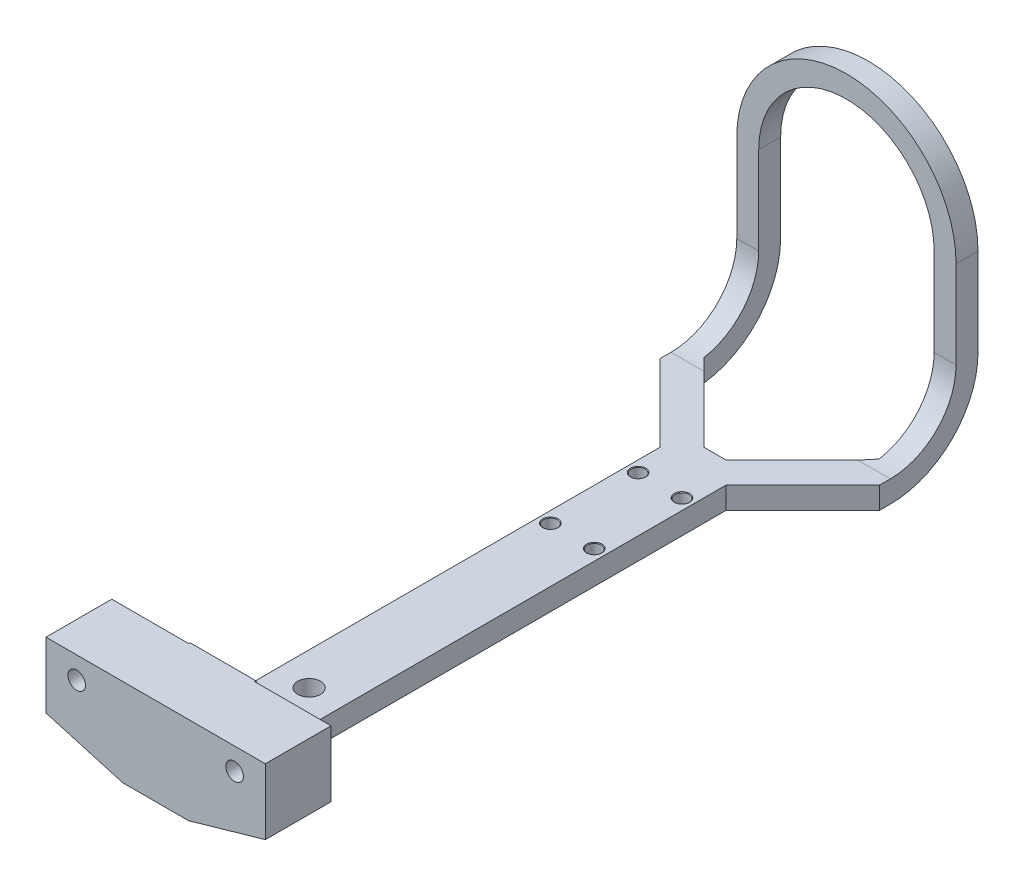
ISO-10303-21;
HEADER;
FILE_DESCRIPTION(('STEP AP214'),'2;1');
FILE_NAME('part.step','',(''),(''),'','','');
FILE_SCHEMA(('AUTOMOTIVE_DESIGN { 1 0 10303 214 1 1 1 1 }'));
ENDSEC;
DATA;
#1=APPLICATION_CONTEXT('core data for automotive mechanical design processes');
#2=APPLICATION_PROTOCOL_DEFINITION('international standard','automotive_design',2000,#1);
#3=PRODUCT_CONTEXT('',#1,'mechanical');
#4=PRODUCT('Part','Part','',(#3));
#5=PRODUCT_RELATED_PRODUCT_CATEGORY('part','',(#4));
#6=PRODUCT_DEFINITION_FORMATION('','',#4);
#7=PRODUCT_DEFINITION_CONTEXT('part definition',#1,'design');
#8=PRODUCT_DEFINITION('design','',#6,#7);
#9=PRODUCT_DEFINITION_SHAPE('','',#8);
#10=(LENGTH_UNIT() NAMED_UNIT(*) SI_UNIT(.MILLI.,.METRE.));
#11=(NAMED_UNIT(*) PLANE_ANGLE_UNIT() SI_UNIT($,.RADIAN.));
#12=(NAMED_UNIT(*) SI_UNIT($,.STERADIAN.) SOLID_ANGLE_UNIT());
#13=UNCERTAINTY_MEASURE_WITH_UNIT(LENGTH_MEASURE(1.E-05),#10,'distance_accuracy_value','');
#14=(GEOMETRIC_REPRESENTATION_CONTEXT(3) GLOBAL_UNCERTAINTY_ASSIGNED_CONTEXT((#13)) GLOBAL_UNIT_ASSIGNED_CONTEXT((#10,
#11,#12)) REPRESENTATION_CONTEXT('',''));
#15=CARTESIAN_POINT('',(0.,0.,0.));
#16=DIRECTION('',(0.,0.,1.));
#17=DIRECTION('',(1.,0.,0.));
#18=AXIS2_PLACEMENT_3D('',#15,#16,#17);
#19=CARTESIAN_POINT('',(0.,5.,0.));
#20=DIRECTION('',(0.,1.,0.));
#21=DIRECTION('',(0.,0.,1.));
#22=AXIS2_PLACEMENT_3D('',#19,#20,#21);
#23=PLANE('',#22);
#24=CARTESIAN_POINT('',(0.,5.,70.));
#25=DIRECTION('',(0.,1.,0.));
#26=DIRECTION('',(0.,0.,1.));
#27=AXIS2_PLACEMENT_3D('',#24,#25,#26);
#28=CIRCLE('',#27,2.6);
#29=CARTESIAN_POINT('',(0.,5.,72.6));
#30=VERTEX_POINT('',#29);
#31=EDGE_CURVE('E436',#30,#30,#28,.F.);
#32=ORIENTED_EDGE('',*,*,#31,.T.);
#33=EDGE_LOOP('',(#32));
#34=FACE_BOUND('',#33,.T.);
#35=CARTESIAN_POINT('',(5.,5.,10.));
#36=DIRECTION('',(0.,1.,0.));
#37=DIRECTION('',(0.,0.,1.));
#38=AXIS2_PLACEMENT_3D('',#35,#36,#37);
#39=CIRCLE('',#38,1.75);
#40=CARTESIAN_POINT('',(5.,5.,11.75));
#41=VERTEX_POINT('',#40);
#42=EDGE_CURVE('E442',#41,#41,#39,.T.);
#43=ORIENTED_EDGE('',*,*,#42,.F.);
#44=EDGE_LOOP('',(#43));
#45=FACE_BOUND('',#44,.T.);
#46=CARTESIAN_POINT('',(-5.,5.,-10.));
#47=DIRECTION('',(0.,1.,0.));
#48=DIRECTION('',(0.,0.,1.));
#49=AXIS2_PLACEMENT_3D('',#46,#47,#48);
#50=CIRCLE('',#49,1.75);
#51=CARTESIAN_POINT('',(-5.,5.,-8.25));
#52=VERTEX_POINT('',#51);
#53=EDGE_CURVE('E451',#52,#52,#50,.T.);
#54=ORIENTED_EDGE('',*,*,#53,.F.);
#55=EDGE_LOOP('',(#54));
#56=FACE_BOUND('',#55,.T.);
#57=CARTESIAN_POINT('',(-5.,5.,10.));
#58=DIRECTION('',(0.,1.,0.));
#59=DIRECTION('',(0.,0.,1.));
#60=AXIS2_PLACEMENT_3D('',#57,#58,#59);
#61=CIRCLE('',#60,1.75);
#62=CARTESIAN_POINT('',(-5.,5.,11.75));
#63=VERTEX_POINT('',#62);
#64=EDGE_CURVE('E460',#63,#63,#61,.T.);
#65=ORIENTED_EDGE('',*,*,#64,.F.);
#66=EDGE_LOOP('',(#65));
#67=FACE_BOUND('',#66,.T.);
#68=CARTESIAN_POINT('',(5.,5.,-10.));
#69=DIRECTION('',(0.,1.,0.));
#70=DIRECTION('',(0.,0.,1.));
#71=AXIS2_PLACEMENT_3D('',#68,#69,#70);
#72=CIRCLE('',#71,1.75);
#73=CARTESIAN_POINT('',(5.,5.,-8.25));
#74=VERTEX_POINT('',#73);
#75=EDGE_CURVE('E469',#74,#74,#72,.T.);
#76=ORIENTED_EDGE('',*,*,#75,.F.);
#77=EDGE_LOOP('',(#76));
#78=FACE_BOUND('',#77,.T.);
#79=DIRECTION('',(0.,0.,-1.));
#80=VECTOR('',#79,1.);
#81=CARTESIAN_POINT('',(-25.,5.,0.));
#82=LINE('',#81,#80);
#83=CARTESIAN_POINT('',(-25.,5.,-35.0000000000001));
#84=VERTEX_POINT('',#83);
#85=CARTESIAN_POINT('',(-25.,5.,-37.5));
#86=VERTEX_POINT('',#85);
#87=EDGE_CURVE('E359',#84,#86,#82,.T.);
#88=ORIENTED_EDGE('',*,*,#87,.F.);
#89=DIRECTION('',(-0.707106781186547,0.,-0.707106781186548));
#90=VECTOR('',#89,1.);
#91=CARTESIAN_POINT('',(5.00000000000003,5.,-5.00000000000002));
#92=LINE('',#91,#90);
#93=CARTESIAN_POINT('',(-7.5,5.,-17.5));
#94=VERTEX_POINT('',#93);
#95=EDGE_CURVE('E592',#84,#94,#92,.F.);
#96=ORIENTED_EDGE('',*,*,#95,.T.);
#97=DIRECTION('',(0.,0.,1.));
#98=VECTOR('',#97,1.);
#99=CARTESIAN_POINT('',(-7.5,5.,0.));
#100=LINE('',#99,#98);
#101=CARTESIAN_POINT('',(-7.49999999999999,5.,82.9999999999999));
#102=VERTEX_POINT('',#101);
#103=EDGE_CURVE('E479',#94,#102,#100,.T.);
#104=ORIENTED_EDGE('',*,*,#103,.T.);
#105=DIRECTION('',(1.,0.,0.));
#106=VECTOR('',#105,1.);
#107=CARTESIAN_POINT('',(0.,5.,82.9999999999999));
#108=LINE('',#107,#106);
#109=CARTESIAN_POINT('',(7.50000000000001,5.,82.9999999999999));
#110=VERTEX_POINT('',#109);
#111=EDGE_CURVE('E507',#102,#110,#108,.T.);
#112=ORIENTED_EDGE('',*,*,#111,.T.);
#113=DIRECTION('',(0.,0.,1.));
#114=VECTOR('',#113,1.);
#115=CARTESIAN_POINT('',(7.5,5.,0.));
#116=LINE('',#115,#114);
#117=CARTESIAN_POINT('',(7.5,5.,-17.5));
#118=VERTEX_POINT('',#117);
#119=EDGE_CURVE('E481',#118,#110,#116,.T.);
#120=ORIENTED_EDGE('',*,*,#119,.F.);
#121=DIRECTION('',(-0.707106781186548,0.,0.707106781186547));
#122=VECTOR('',#121,1.);
#123=CARTESIAN_POINT('',(-5.00000000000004,5.,-5.00000000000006));
#124=LINE('',#123,#122);
#125=CARTESIAN_POINT('',(25.,5.,-35.));
#126=VERTEX_POINT('',#125);
#127=EDGE_CURVE('E590',#118,#126,#124,.F.);
#128=ORIENTED_EDGE('',*,*,#127,.T.);
#129=DIRECTION('',(0.,0.,1.));
#130=VECTOR('',#129,1.);
#131=CARTESIAN_POINT('',(25.,5.,0.));
#132=LINE('',#131,#130);
#133=CARTESIAN_POINT('',(25.,5.,-37.5));
#134=VERTEX_POINT('',#133);
#135=EDGE_CURVE('E373',#134,#126,#132,.T.);
#136=ORIENTED_EDGE('',*,*,#135,.F.);
#137=DIRECTION('',(1.,0.,0.));
#138=VECTOR('',#137,1.);
#139=CARTESIAN_POINT('',(0.,5.,-37.5));
#140=LINE('',#139,#138);
#141=CARTESIAN_POINT('',(17.5,5.,-37.5));
#142=VERTEX_POINT('',#141);
#143=EDGE_CURVE('E139',#134,#142,#140,.F.);
#144=ORIENTED_EDGE('',*,*,#143,.T.);
#145=DIRECTION('',(-0.707106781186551,0.,0.707106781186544));
#146=VECTOR('',#145,1.);
#147=CARTESIAN_POINT('',(20.,5.,-39.9999999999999));
#148=LINE('',#147,#146);
#149=CARTESIAN_POINT('',(2.49999999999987,5.,-22.5));
#150=VERTEX_POINT('',#149);
#151=EDGE_CURVE('E584',#142,#150,#148,.T.);
#152=ORIENTED_EDGE('',*,*,#151,.T.);
#153=DIRECTION('',(-1.,0.,0.));
#154=VECTOR('',#153,1.);
#155=CARTESIAN_POINT('',(7.5,5.,-22.5));
#156=LINE('',#155,#154);
#157=CARTESIAN_POINT('',(-2.50000000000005,5.,-22.5));
#158=VERTEX_POINT('',#157);
#159=EDGE_CURVE('E364',#150,#158,#156,.T.);
#160=ORIENTED_EDGE('',*,*,#159,.T.);
#161=DIRECTION('',(0.707106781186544,0.,0.707106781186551));
#162=VECTOR('',#161,1.);
#163=CARTESIAN_POINT('',(-2.50000000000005,5.,-22.5));
#164=LINE('',#163,#162);
#165=CARTESIAN_POINT('',(-17.4999999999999,5.,-37.5));
#166=VERTEX_POINT('',#165);
#167=EDGE_CURVE('E572',#158,#166,#164,.F.);
#168=ORIENTED_EDGE('',*,*,#167,.T.);
#169=DIRECTION('',(-1.,0.,0.));
#170=VECTOR('',#169,1.);
#171=CARTESIAN_POINT('',(0.,5.,-37.5));
#172=LINE('',#171,#170);
#173=EDGE_CURVE('E529',#166,#86,#172,.T.);
#174=ORIENTED_EDGE('',*,*,#173,.T.);
#175=EDGE_LOOP('',(#88,#96,#104,#112,#120,#128,#136,#144,#152,#160,#168,#174));
#176=FACE_BOUND('',#175,.T.);
#177=ADVANCED_FACE('F115',(#34,#45,#56,#67,#78,#176),#23,.T.);
#178=CARTESIAN_POINT('',(-7.5,5.,0.));
#179=DIRECTION('',(1.,0.,0.));
#180=DIRECTION('',(0.,0.,-1.));
#181=AXIS2_PLACEMENT_3D('',#178,#179,#180);
#182=PLANE('',#181);
#183=DIRECTION('',(0.,1.,0.));
#184=VECTOR('',#183,1.);
#185=CARTESIAN_POINT('',(-7.5,0.,-17.5));
#186=LINE('',#185,#184);
#187=CARTESIAN_POINT('',(-7.5,0.,-17.5));
#188=VERTEX_POINT('',#187);
#189=EDGE_CURVE('E358',#188,#94,#186,.T.);
#190=ORIENTED_EDGE('',*,*,#189,.F.);
#191=DIRECTION('',(0.,0.,1.));
#192=VECTOR('',#191,1.);
#193=CARTESIAN_POINT('',(-7.5,0.,0.));
#194=LINE('',#193,#192);
#195=CARTESIAN_POINT('',(-7.49999999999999,0.,90.));
#196=VERTEX_POINT('',#195);
#197=EDGE_CURVE('E485',#188,#196,#194,.T.);
#198=ORIENTED_EDGE('',*,*,#197,.T.);
#199=DIRECTION('',(0.,1.,0.));
#200=VECTOR('',#199,1.);
#201=CARTESIAN_POINT('',(-7.49999999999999,20.,90.));
#202=LINE('',#201,#200);
#203=CARTESIAN_POINT('',(-7.49999999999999,20.,90.));
#204=VERTEX_POINT('',#203);
#205=EDGE_CURVE('E496',#196,#204,#202,.T.);
#206=ORIENTED_EDGE('',*,*,#205,.T.);
#207=DIRECTION('',(0.,0.,1.));
#208=VECTOR('',#207,1.);
#209=CARTESIAN_POINT('',(-7.5,20.,0.));
#210=LINE('',#209,#208);
#211=CARTESIAN_POINT('',(-7.49999999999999,20.,89.6784302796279));
#212=VERTEX_POINT('',#211);
#213=EDGE_CURVE('E518',#204,#212,#210,.F.);
#214=ORIENTED_EDGE('',*,*,#213,.T.);
#215=DIRECTION('',(0.,-0.913545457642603,-0.406736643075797));
#216=VECTOR('',#215,1.);
#217=CARTESIAN_POINT('',(-7.49999999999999,-25.8405102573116,69.2689201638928));
#218=LINE('',#217,#216);
#219=EDGE_CURVE('E512',#212,#102,#218,.T.);
#220=ORIENTED_EDGE('',*,*,#219,.T.);
#221=ORIENTED_EDGE('',*,*,#103,.F.);
#222=EDGE_LOOP('',(#190,#198,#206,#214,#220,#221));
#223=FACE_BOUND('',#222,.T.);
#224=ADVANCED_FACE('F656',(#223),#182,.F.);
#225=CARTESIAN_POINT('',(7.5,5.,0.));
#226=DIRECTION('',(1.,0.,0.));
#227=DIRECTION('',(0.,0.,-1.));
#228=AXIS2_PLACEMENT_3D('',#225,#226,#227);
#229=PLANE('',#228);
#230=DIRECTION('',(0.,0.,1.));
#231=VECTOR('',#230,1.);
#232=CARTESIAN_POINT('',(7.5,0.,0.));
#233=LINE('',#232,#231);
#234=CARTESIAN_POINT('',(7.5,0.,-17.5));
#235=VERTEX_POINT('',#234);
#236=CARTESIAN_POINT('',(7.50000000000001,0.,90.));
#237=VERTEX_POINT('',#236);
#238=EDGE_CURVE('E482',#235,#237,#233,.T.);
#239=ORIENTED_EDGE('',*,*,#238,.F.);
#240=DIRECTION('',(0.,1.,0.));
#241=VECTOR('',#240,1.);
#242=CARTESIAN_POINT('',(7.5,0.,-17.5));
#243=LINE('',#242,#241);
#244=EDGE_CURVE('E361',#235,#118,#243,.T.);
#245=ORIENTED_EDGE('',*,*,#244,.T.);
#246=ORIENTED_EDGE('',*,*,#119,.T.);
#247=DIRECTION('',(0.,0.913545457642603,0.406736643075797));
#248=VECTOR('',#247,1.);
#249=CARTESIAN_POINT('',(7.50000000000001,20.7222574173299,90.));
#250=LINE('',#249,#248);
#251=CARTESIAN_POINT('',(7.50000000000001,20.,89.6784302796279));
#252=VERTEX_POINT('',#251);
#253=EDGE_CURVE('E515',#110,#252,#250,.T.);
#254=ORIENTED_EDGE('',*,*,#253,.T.);
#255=DIRECTION('',(0.,0.,-1.));
#256=VECTOR('',#255,1.);
#257=CARTESIAN_POINT('',(7.5,20.,0.));
#258=LINE('',#257,#256);
#259=CARTESIAN_POINT('',(7.50000000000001,20.,90.));
#260=VERTEX_POINT('',#259);
#261=EDGE_CURVE('E517',#260,#252,#258,.T.);
#262=ORIENTED_EDGE('',*,*,#261,.F.);
#263=DIRECTION('',(0.,-1.,0.));
#264=VECTOR('',#263,1.);
#265=CARTESIAN_POINT('',(7.50000000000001,5.,90.));
#266=LINE('',#265,#264);
#267=EDGE_CURVE('E484',#260,#237,#266,.T.);
#268=ORIENTED_EDGE('',*,*,#267,.T.);
#269=EDGE_LOOP('',(#239,#245,#246,#254,#262,#268));
#270=FACE_BOUND('',#269,.T.);
#271=ADVANCED_FACE('F605',(#270),#229,.T.);
#272=CARTESIAN_POINT('',(-25.,20.,90.));
#273=DIRECTION('',(0.,0.,1.));
#274=DIRECTION('',(1.,0.,0.));
#275=AXIS2_PLACEMENT_3D('',#272,#273,#274);
#276=PLANE('',#275);
#277=CARTESIAN_POINT('',(-18.,15.,90.));
#278=DIRECTION('',(0.,0.,1.));
#279=DIRECTION('',(1.,0.,0.));
#280=AXIS2_PLACEMENT_3D('',#277,#278,#279);
#281=CIRCLE('',#280,2.00000000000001);
#282=CARTESIAN_POINT('',(-16.,15.,90.));
#283=VERTEX_POINT('',#282);
#284=EDGE_CURVE('E394',#283,#283,#281,.T.);
#285=ORIENTED_EDGE('',*,*,#284,.T.);
#286=EDGE_LOOP('',(#285));
#287=FACE_BOUND('',#286,.T.);
#288=DIRECTION('',(-1.,0.,0.));
#289=VECTOR('',#288,1.);
#290=CARTESIAN_POINT('',(-25.,20.,90.));
#291=LINE('',#290,#289);
#292=CARTESIAN_POINT('',(-25.,20.,90.));
#293=VERTEX_POINT('',#292);
#294=EDGE_CURVE('E406',#204,#293,#291,.T.);
#295=ORIENTED_EDGE('',*,*,#294,.F.);
#296=ORIENTED_EDGE('',*,*,#205,.F.);
#297=DIRECTION('',(0.961261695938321,-0.275637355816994,0.));
#298=VECTOR('',#297,1.);
#299=CARTESIAN_POINT('',(-28.9696134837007,6.15631260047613,90.));
#300=LINE('',#299,#298);
#301=CARTESIAN_POINT('',(-24.9370722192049,5.,90.));
#302=VERTEX_POINT('',#301);
#303=EDGE_CURVE('E505',#196,#302,#300,.F.);
#304=ORIENTED_EDGE('',*,*,#303,.T.);
#305=DIRECTION('',(-1.,0.,0.));
#306=VECTOR('',#305,1.);
#307=CARTESIAN_POINT('',(-25.,5.,90.));
#308=LINE('',#307,#306);
#309=CARTESIAN_POINT('',(-25.,5.,90.));
#310=VERTEX_POINT('',#309);
#311=EDGE_CURVE('E419',#302,#310,#308,.T.);
#312=ORIENTED_EDGE('',*,*,#311,.T.);
#313=DIRECTION('',(0.,-1.,0.));
#314=VECTOR('',#313,1.);
#315=CARTESIAN_POINT('',(-25.,20.,90.));
#316=LINE('',#315,#314);
#317=EDGE_CURVE('E410',#293,#310,#316,.T.);
#318=ORIENTED_EDGE('',*,*,#317,.F.);
#319=EDGE_LOOP('',(#295,#296,#304,#312,#318));
#320=FACE_BOUND('',#319,.T.);
#321=ADVANCED_FACE('F693',(#287,#320),#276,.F.);
#322=CARTESIAN_POINT('',(0.,0.,0.));
#323=DIRECTION('',(0.,1.,0.));
#324=DIRECTION('',(0.,0.,1.));
#325=AXIS2_PLACEMENT_3D('',#322,#323,#324);
#326=PLANE('',#325);
#327=ORIENTED_EDGE('',*,*,#197,.F.);
#328=DIRECTION('',(0.707106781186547,0.,0.707106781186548));
#329=VECTOR('',#328,1.);
#330=CARTESIAN_POINT('',(-25.,0.,-35.0000000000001));
#331=LINE('',#330,#329);
#332=CARTESIAN_POINT('',(-25.,0.,-35.0000000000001));
#333=VERTEX_POINT('',#332);
#334=EDGE_CURVE('E12',#188,#333,#331,.F.);
#335=ORIENTED_EDGE('',*,*,#334,.T.);
#336=DIRECTION('',(0.,0.,-1.));
#337=VECTOR('',#336,1.);
#338=CARTESIAN_POINT('',(-25.,0.,0.));
#339=LINE('',#338,#337);
#340=CARTESIAN_POINT('',(-25.,0.,-37.5));
#341=VERTEX_POINT('',#340);
#342=EDGE_CURVE('E356',#333,#341,#339,.T.);
#343=ORIENTED_EDGE('',*,*,#342,.T.);
#344=DIRECTION('',(1.,0.,0.));
#345=VECTOR('',#344,1.);
#346=CARTESIAN_POINT('',(0.,0.,-37.5));
#347=LINE('',#346,#345);
#348=CARTESIAN_POINT('',(-17.4999999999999,0.,-37.5));
#349=VERTEX_POINT('',#348);
#350=EDGE_CURVE('E542',#341,#349,#347,.T.);
#351=ORIENTED_EDGE('',*,*,#350,.T.);
#352=DIRECTION('',(-0.707106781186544,0.,-0.707106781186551));
#353=VECTOR('',#352,1.);
#354=CARTESIAN_POINT('',(9.99999999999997,0.,-9.99999999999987));
#355=LINE('',#354,#353);
#356=CARTESIAN_POINT('',(-2.50000000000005,0.,-22.5));
#357=VERTEX_POINT('',#356);
#358=EDGE_CURVE('E580',#349,#357,#355,.F.);
#359=ORIENTED_EDGE('',*,*,#358,.T.);
#360=DIRECTION('',(-1.,0.,0.));
#361=VECTOR('',#360,1.);
#362=CARTESIAN_POINT('',(7.5,0.,-22.5));
#363=LINE('',#362,#361);
#364=CARTESIAN_POINT('',(2.49999999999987,0.,-22.5));
#365=VERTEX_POINT('',#364);
#366=EDGE_CURVE('E382',#365,#357,#363,.T.);
#367=ORIENTED_EDGE('',*,*,#366,.F.);
#368=DIRECTION('',(0.707106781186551,0.,-0.707106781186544));
#369=VECTOR('',#368,1.);
#370=CARTESIAN_POINT('',(-10.0000000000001,0.,-10.0000000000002));
#371=LINE('',#370,#369);
#372=CARTESIAN_POINT('',(17.5,0.,-37.5));
#373=VERTEX_POINT('',#372);
#374=EDGE_CURVE('E586',#365,#373,#371,.T.);
#375=ORIENTED_EDGE('',*,*,#374,.T.);
#376=DIRECTION('',(-1.,0.,0.));
#377=VECTOR('',#376,1.);
#378=CARTESIAN_POINT('',(0.,0.,-37.5));
#379=LINE('',#378,#377);
#380=CARTESIAN_POINT('',(25.,0.,-37.5));
#381=VERTEX_POINT('',#380);
#382=EDGE_CURVE('E131',#373,#381,#379,.F.);
#383=ORIENTED_EDGE('',*,*,#382,.T.);
#384=DIRECTION('',(0.,0.,1.));
#385=VECTOR('',#384,1.);
#386=CARTESIAN_POINT('',(25.,0.,0.));
#387=LINE('',#386,#385);
#388=CARTESIAN_POINT('',(25.,0.,-35.));
#389=VERTEX_POINT('',#388);
#390=EDGE_CURVE('E369',#381,#389,#387,.T.);
#391=ORIENTED_EDGE('',*,*,#390,.T.);
#392=DIRECTION('',(0.707106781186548,0.,-0.707106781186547));
#393=VECTOR('',#392,1.);
#394=CARTESIAN_POINT('',(7.49999999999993,0.,-17.5));
#395=LINE('',#394,#393);
#396=EDGE_CURVE('E124',#389,#235,#395,.F.);
#397=ORIENTED_EDGE('',*,*,#396,.T.);
#398=ORIENTED_EDGE('',*,*,#238,.T.);
#399=CARTESIAN_POINT('',(7.50000000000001,0.,105.));
#400=VERTEX_POINT('',#399);
#401=EDGE_CURVE('E487',#237,#400,#233,.T.);
#402=ORIENTED_EDGE('',*,*,#401,.T.);
#403=DIRECTION('',(1.,0.,0.));
#404=VECTOR('',#403,1.);
#405=CARTESIAN_POINT('',(-7.49999999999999,0.,105.));
#406=LINE('',#405,#404);
#407=CARTESIAN_POINT('',(-7.49999999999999,0.,105.));
#408=VERTEX_POINT('',#407);
#409=EDGE_CURVE('E439',#408,#400,#406,.T.);
#410=ORIENTED_EDGE('',*,*,#409,.F.);
#411=EDGE_CURVE('E478',#196,#408,#194,.T.);
#412=ORIENTED_EDGE('',*,*,#411,.F.);
#413=EDGE_LOOP('',(#327,#335,#343,#351,#359,#367,#375,#383,#391,#397,#398,#402,#410,#412));
#414=FACE_BOUND('',#413,.T.);
#415=CARTESIAN_POINT('',(5.,0.,-10.));
#416=DIRECTION('',(0.,1.,0.));
#417=DIRECTION('',(0.,0.,1.));
#418=AXIS2_PLACEMENT_3D('',#415,#416,#417);
#419=CIRCLE('',#418,1.6);
#420=CARTESIAN_POINT('',(5.,0.,-8.4));
#421=VERTEX_POINT('',#420);
#422=EDGE_CURVE('E475',#421,#421,#419,.T.);
#423=ORIENTED_EDGE('',*,*,#422,.T.);
#424=EDGE_LOOP('',(#423));
#425=FACE_BOUND('',#424,.T.);
#426=CARTESIAN_POINT('',(-5.,0.,10.));
#427=DIRECTION('',(0.,1.,0.));
#428=DIRECTION('',(0.,0.,1.));
#429=AXIS2_PLACEMENT_3D('',#426,#427,#428);
#430=CIRCLE('',#429,1.6);
#431=CARTESIAN_POINT('',(-5.,0.,11.6));
#432=VERTEX_POINT('',#431);
#433=EDGE_CURVE('E466',#432,#432,#430,.T.);
#434=ORIENTED_EDGE('',*,*,#433,.T.);
#435=EDGE_LOOP('',(#434));
#436=FACE_BOUND('',#435,.T.);
#437=CARTESIAN_POINT('',(-5.,0.,-10.));
#438=DIRECTION('',(0.,1.,0.));
#439=DIRECTION('',(0.,0.,1.));
#440=AXIS2_PLACEMENT_3D('',#437,#438,#439);
#441=CIRCLE('',#440,1.6);
#442=CARTESIAN_POINT('',(-5.,0.,-8.4));
#443=VERTEX_POINT('',#442);
#444=EDGE_CURVE('E457',#443,#443,#441,.T.);
#445=ORIENTED_EDGE('',*,*,#444,.T.);
#446=EDGE_LOOP('',(#445));
#447=FACE_BOUND('',#446,.T.);
#448=CARTESIAN_POINT('',(5.,0.,10.));
#449=DIRECTION('',(0.,1.,0.));
#450=DIRECTION('',(0.,0.,1.));
#451=AXIS2_PLACEMENT_3D('',#448,#449,#450);
#452=CIRCLE('',#451,1.6);
#453=CARTESIAN_POINT('',(5.,0.,11.6));
#454=VERTEX_POINT('',#453);
#455=EDGE_CURVE('E448',#454,#454,#452,.T.);
#456=ORIENTED_EDGE('',*,*,#455,.T.);
#457=EDGE_LOOP('',(#456));
#458=FACE_BOUND('',#457,.T.);
#459=CARTESIAN_POINT('',(0.,0.,70.));
#460=DIRECTION('',(0.,1.,0.));
#461=DIRECTION('',(0.,0.,1.));
#462=AXIS2_PLACEMENT_3D('',#459,#460,#461);
#463=CIRCLE('',#462,2.6);
#464=CARTESIAN_POINT('',(0.,0.,72.6));
#465=VERTEX_POINT('',#464);
#466=EDGE_CURVE('E433',#465,#465,#463,.T.);
#467=ORIENTED_EDGE('',*,*,#466,.T.);
#468=EDGE_LOOP('',(#467));
#469=FACE_BOUND('',#468,.T.);
#470=ADVANCED_FACE('F597',(#414,#425,#436,#447,#458,#469),#326,.F.);
#471=CARTESIAN_POINT('',(5.,5.,-10.));
#472=DIRECTION('',(0.,1.,0.));
#473=DIRECTION('',(0.,0.,1.));
#474=AXIS2_PLACEMENT_3D('',#471,#472,#473);
#475=CYLINDRICAL_SURFACE('',#474,1.6);
#476=ORIENTED_EDGE('',*,*,#422,.F.);
#477=EDGE_LOOP('',(#476));
#478=FACE_BOUND('',#477,.T.);
#479=CARTESIAN_POINT('',(5.,4.87413505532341,-10.));
#480=DIRECTION('',(0.,1.,0.));
#481=DIRECTION('',(0.,0.,1.));
#482=AXIS2_PLACEMENT_3D('',#479,#480,#481);
#483=CIRCLE('',#482,1.6);
#484=CARTESIAN_POINT('',(5.,4.87413505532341,-8.4));
#485=VERTEX_POINT('',#484);
#486=EDGE_CURVE('E472',#485,#485,#483,.T.);
#487=ORIENTED_EDGE('',*,*,#486,.T.);
#488=EDGE_LOOP('',(#487));
#489=FACE_BOUND('',#488,.T.);
#490=ADVANCED_FACE('F727',(#478,#489),#475,.F.);
#491=CARTESIAN_POINT('',(5.,5.,-10.));
#492=DIRECTION('',(0.,1.,0.));
#493=DIRECTION('',(0.,0.,1.));
#494=AXIS2_PLACEMENT_3D('',#491,#492,#493);
#495=CONICAL_SURFACE('',#494,1.75,0.872664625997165);
#496=ORIENTED_EDGE('',*,*,#486,.F.);
#497=EDGE_LOOP('',(#496));
#498=FACE_BOUND('',#497,.T.);
#499=ORIENTED_EDGE('',*,*,#75,.T.);
#500=EDGE_LOOP('',(#499));
#501=FACE_BOUND('',#500,.T.);
#502=ADVANCED_FACE('F1220',(#498,#501),#495,.F.);
#503=CARTESIAN_POINT('',(-5.,5.,10.));
#504=DIRECTION('',(0.,1.,0.));
#505=DIRECTION('',(0.,0.,1.));
#506=AXIS2_PLACEMENT_3D('',#503,#504,#505);
#507=CYLINDRICAL_SURFACE('',#506,1.6);
#508=ORIENTED_EDGE('',*,*,#433,.F.);
#509=EDGE_LOOP('',(#508));
#510=FACE_BOUND('',#509,.T.);
#511=CARTESIAN_POINT('',(-5.,4.87413505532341,10.));
#512=DIRECTION('',(0.,1.,0.));
#513=DIRECTION('',(0.,0.,1.));
#514=AXIS2_PLACEMENT_3D('',#511,#512,#513);
#515=CIRCLE('',#514,1.6);
#516=CARTESIAN_POINT('',(-5.,4.87413505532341,11.6));
#517=VERTEX_POINT('',#516);
#518=EDGE_CURVE('E463',#517,#517,#515,.T.);
#519=ORIENTED_EDGE('',*,*,#518,.T.);
#520=EDGE_LOOP('',(#519));
#521=FACE_BOUND('',#520,.T.);
#522=ADVANCED_FACE('F1210',(#510,#521),#507,.F.);
#523=CARTESIAN_POINT('',(-5.,5.,10.));
#524=DIRECTION('',(0.,1.,0.));
#525=DIRECTION('',(0.,0.,1.));
#526=AXIS2_PLACEMENT_3D('',#523,#524,#525);
#527=CONICAL_SURFACE('',#526,1.75,0.872664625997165);
#528=ORIENTED_EDGE('',*,*,#518,.F.);
#529=EDGE_LOOP('',(#528));
#530=FACE_BOUND('',#529,.T.);
#531=ORIENTED_EDGE('',*,*,#64,.T.);
#532=EDGE_LOOP('',(#531));
#533=FACE_BOUND('',#532,.T.);
#534=ADVANCED_FACE('F1200',(#530,#533),#527,.F.);
#535=CARTESIAN_POINT('',(-5.,5.,-10.));
#536=DIRECTION('',(0.,1.,0.));
#537=DIRECTION('',(0.,0.,1.));
#538=AXIS2_PLACEMENT_3D('',#535,#536,#537);
#539=CYLINDRICAL_SURFACE('',#538,1.6);
#540=ORIENTED_EDGE('',*,*,#444,.F.);
#541=EDGE_LOOP('',(#540));
#542=FACE_BOUND('',#541,.T.);
#543=CARTESIAN_POINT('',(-5.,4.87413505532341,-10.));
#544=DIRECTION('',(0.,1.,0.));
#545=DIRECTION('',(0.,0.,1.));
#546=AXIS2_PLACEMENT_3D('',#543,#544,#545);
#547=CIRCLE('',#546,1.6);
#548=CARTESIAN_POINT('',(-5.,4.87413505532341,-8.4));
#549=VERTEX_POINT('',#548);
#550=EDGE_CURVE('E454',#549,#549,#547,.T.);
#551=ORIENTED_EDGE('',*,*,#550,.T.);
#552=EDGE_LOOP('',(#551));
#553=FACE_BOUND('',#552,.T.);
#554=ADVANCED_FACE('F1190',(#542,#553),#539,.F.);
#555=CARTESIAN_POINT('',(-5.,5.,-10.));
#556=DIRECTION('',(0.,1.,0.));
#557=DIRECTION('',(0.,0.,1.));
#558=AXIS2_PLACEMENT_3D('',#555,#556,#557);
#559=CONICAL_SURFACE('',#558,1.75,0.872664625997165);
#560=ORIENTED_EDGE('',*,*,#550,.F.);
#561=EDGE_LOOP('',(#560));
#562=FACE_BOUND('',#561,.T.);
#563=ORIENTED_EDGE('',*,*,#53,.T.);
#564=EDGE_LOOP('',(#563));
#565=FACE_BOUND('',#564,.T.);
#566=ADVANCED_FACE('F1180',(#562,#565),#559,.F.);
#567=CARTESIAN_POINT('',(5.,5.,10.));
#568=DIRECTION('',(0.,1.,0.));
#569=DIRECTION('',(0.,0.,1.));
#570=AXIS2_PLACEMENT_3D('',#567,#568,#569);
#571=CYLINDRICAL_SURFACE('',#570,1.6);
#572=ORIENTED_EDGE('',*,*,#455,.F.);
#573=EDGE_LOOP('',(#572));
#574=FACE_BOUND('',#573,.T.);
#575=CARTESIAN_POINT('',(5.,4.87413505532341,10.));
#576=DIRECTION('',(0.,1.,0.));
#577=DIRECTION('',(0.,0.,1.));
#578=AXIS2_PLACEMENT_3D('',#575,#576,#577);
#579=CIRCLE('',#578,1.6);
#580=CARTESIAN_POINT('',(5.,4.87413505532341,11.6));
#581=VERTEX_POINT('',#580);
#582=EDGE_CURVE('E445',#581,#581,#579,.T.);
#583=ORIENTED_EDGE('',*,*,#582,.T.);
#584=EDGE_LOOP('',(#583));
#585=FACE_BOUND('',#584,.T.);
#586=ADVANCED_FACE('F1170',(#574,#585),#571,.F.);
#587=CARTESIAN_POINT('',(5.,5.,10.));
#588=DIRECTION('',(0.,1.,0.));
#589=DIRECTION('',(0.,0.,1.));
#590=AXIS2_PLACEMENT_3D('',#587,#588,#589);
#591=CONICAL_SURFACE('',#590,1.75,0.872664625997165);
#592=ORIENTED_EDGE('',*,*,#582,.F.);
#593=EDGE_LOOP('',(#592));
#594=FACE_BOUND('',#593,.T.);
#595=ORIENTED_EDGE('',*,*,#42,.T.);
#596=EDGE_LOOP('',(#595));
#597=FACE_BOUND('',#596,.T.);
#598=ADVANCED_FACE('F846',(#594,#597),#591,.F.);
#599=CARTESIAN_POINT('',(-7.49999999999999,0.,105.));
#600=DIRECTION('',(0.,0.,1.));
#601=DIRECTION('',(1.,0.,0.));
#602=AXIS2_PLACEMENT_3D('',#599,#600,#601);
#603=PLANE('',#602);
#604=CARTESIAN_POINT('',(-18.,15.,105.));
#605=DIRECTION('',(0.,0.,1.));
#606=DIRECTION('',(1.,0.,0.));
#607=AXIS2_PLACEMENT_3D('',#604,#605,#606);
#608=CIRCLE('',#607,2.00000000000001);
#609=CARTESIAN_POINT('',(-16.,15.,105.));
#610=VERTEX_POINT('',#609);
#611=EDGE_CURVE('E388',#610,#610,#608,.T.);
#612=ORIENTED_EDGE('',*,*,#611,.F.);
#613=EDGE_LOOP('',(#612));
#614=FACE_BOUND('',#613,.T.);
#615=CARTESIAN_POINT('',(18.,15.,105.));
#616=DIRECTION('',(0.,0.,1.));
#617=DIRECTION('',(1.,0.,0.));
#618=AXIS2_PLACEMENT_3D('',#615,#616,#617);
#619=CIRCLE('',#618,2.00000000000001);
#620=CARTESIAN_POINT('',(20.,15.,105.));
#621=VERTEX_POINT('',#620);
#622=EDGE_CURVE('E385',#621,#621,#619,.T.);
#623=ORIENTED_EDGE('',*,*,#622,.F.);
#624=EDGE_LOOP('',(#623));
#625=FACE_BOUND('',#624,.T.);
#626=ORIENTED_EDGE('',*,*,#409,.T.);
#627=DIRECTION('',(0.96126169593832,0.275637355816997,0.));
#628=VECTOR('',#627,1.);
#629=CARTESIAN_POINT('',(7.5,-1.26675281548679E-13,105.));
#630=LINE('',#629,#628);
#631=CARTESIAN_POINT('',(24.9370722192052,5.,105.));
#632=VERTEX_POINT('',#631);
#633=EDGE_CURVE('E498',#400,#632,#630,.T.);
#634=ORIENTED_EDGE('',*,*,#633,.T.);
#635=DIRECTION('',(1.,0.,0.));
#636=VECTOR('',#635,1.);
#637=CARTESIAN_POINT('',(-25.,5.,105.));
#638=LINE('',#637,#636);
#639=CARTESIAN_POINT('',(25.,5.,105.));
#640=VERTEX_POINT('',#639);
#641=EDGE_CURVE('E413',#632,#640,#638,.T.);
#642=ORIENTED_EDGE('',*,*,#641,.T.);
#643=DIRECTION('',(0.,-1.,0.));
#644=VECTOR('',#643,1.);
#645=CARTESIAN_POINT('',(25.,20.,105.));
#646=LINE('',#645,#644);
#647=CARTESIAN_POINT('',(25.,20.,105.));
#648=VERTEX_POINT('',#647);
#649=EDGE_CURVE('E427',#648,#640,#646,.T.);
#650=ORIENTED_EDGE('',*,*,#649,.F.);
#651=DIRECTION('',(1.,0.,0.));
#652=VECTOR('',#651,1.);
#653=CARTESIAN_POINT('',(-25.,20.,105.));
#654=LINE('',#653,#652);
#655=CARTESIAN_POINT('',(-25.,20.,105.));
#656=VERTEX_POINT('',#655);
#657=EDGE_CURVE('E401',#656,#648,#654,.T.);
#658=ORIENTED_EDGE('',*,*,#657,.F.);
#659=DIRECTION('',(0.,-1.,0.));
#660=VECTOR('',#659,1.);
#661=CARTESIAN_POINT('',(-25.,20.,105.));
#662=LINE('',#661,#660);
#663=CARTESIAN_POINT('',(-25.,5.,105.));
#664=VERTEX_POINT('',#663);
#665=EDGE_CURVE('E430',#656,#664,#662,.T.);
#666=ORIENTED_EDGE('',*,*,#665,.T.);
#667=CARTESIAN_POINT('',(-24.9370722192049,5.,105.));
#668=VERTEX_POINT('',#667);
#669=EDGE_CURVE('E414',#664,#668,#638,.T.);
#670=ORIENTED_EDGE('',*,*,#669,.T.);
#671=DIRECTION('',(-0.961261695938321,0.275637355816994,0.));
#672=VECTOR('',#671,1.);
#673=CARTESIAN_POINT('',(-24.9370722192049,5.,105.));
#674=LINE('',#673,#672);
#675=EDGE_CURVE('E503',#668,#408,#674,.F.);
#676=ORIENTED_EDGE('',*,*,#675,.T.);
#677=EDGE_LOOP('',(#626,#634,#642,#650,#658,#666,#670,#676));
#678=FACE_BOUND('',#677,.T.);
#679=ADVANCED_FACE('F680',(#614,#625,#678),#603,.T.);
#680=CARTESIAN_POINT('',(0.,11.,70.));
#681=DIRECTION('',(0.,-1.,0.));
#682=DIRECTION('',(0.,0.,-1.));
#683=AXIS2_PLACEMENT_3D('',#680,#681,#682);
#684=CYLINDRICAL_SURFACE('',#683,2.6);
#685=ORIENTED_EDGE('',*,*,#31,.F.);
#686=EDGE_LOOP('',(#685));
#687=FACE_BOUND('',#686,.T.);
#688=ORIENTED_EDGE('',*,*,#466,.F.);
#689=EDGE_LOOP('',(#688));
#690=FACE_BOUND('',#689,.T.);
#691=ADVANCED_FACE('F715',(#687,#690),#684,.F.);
#692=CARTESIAN_POINT('',(0.,5.,0.));
#693=DIRECTION('',(0.,1.,0.));
#694=DIRECTION('',(0.,0.,1.));
#695=AXIS2_PLACEMENT_3D('',#692,#693,#694);
#696=PLANE('',#695);
#697=ORIENTED_EDGE('',*,*,#311,.F.);
#698=DIRECTION('',(0.,0.,1.));
#699=VECTOR('',#698,1.);
#700=CARTESIAN_POINT('',(-24.9370722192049,5.,105.));
#701=LINE('',#700,#699);
#702=EDGE_CURVE('E493',#302,#668,#701,.T.);
#703=ORIENTED_EDGE('',*,*,#702,.T.);
#704=ORIENTED_EDGE('',*,*,#669,.F.);
#705=DIRECTION('',(0.,0.,1.));
#706=VECTOR('',#705,1.);
#707=CARTESIAN_POINT('',(-25.,5.,90.));
#708=LINE('',#707,#706);
#709=EDGE_CURVE('E397',#310,#664,#708,.T.);
#710=ORIENTED_EDGE('',*,*,#709,.F.);
#711=EDGE_LOOP('',(#697,#703,#704,#710));
#712=FACE_BOUND('',#711,.T.);
#713=ADVANCED_FACE('F688',(#712),#696,.F.);
#714=CARTESIAN_POINT('',(-25.,20.,90.));
#715=DIRECTION('',(1.,0.,0.));
#716=DIRECTION('',(0.,0.,-1.));
#717=AXIS2_PLACEMENT_3D('',#714,#715,#716);
#718=PLANE('',#717);
#719=ORIENTED_EDGE('',*,*,#709,.T.);
#720=ORIENTED_EDGE('',*,*,#665,.F.);
#721=DIRECTION('',(0.,0.,1.));
#722=VECTOR('',#721,1.);
#723=CARTESIAN_POINT('',(-25.,20.,90.));
#724=LINE('',#723,#722);
#725=EDGE_CURVE('E398',#293,#656,#724,.T.);
#726=ORIENTED_EDGE('',*,*,#725,.F.);
#727=ORIENTED_EDGE('',*,*,#317,.T.);
#728=EDGE_LOOP('',(#719,#720,#726,#727));
#729=FACE_BOUND('',#728,.T.);
#730=ADVANCED_FACE('F697',(#729),#718,.F.);
#731=CARTESIAN_POINT('',(25.,20.,90.));
#732=DIRECTION('',(-1.,0.,0.));
#733=DIRECTION('',(0.,0.,1.));
#734=AXIS2_PLACEMENT_3D('',#731,#732,#733);
#735=PLANE('',#734);
#736=DIRECTION('',(0.,0.,-1.));
#737=VECTOR('',#736,1.);
#738=CARTESIAN_POINT('',(25.,5.,90.));
#739=LINE('',#738,#737);
#740=CARTESIAN_POINT('',(25.,5.,90.));
#741=VERTEX_POINT('',#740);
#742=EDGE_CURVE('E417',#640,#741,#739,.T.);
#743=ORIENTED_EDGE('',*,*,#742,.T.);
#744=DIRECTION('',(0.,-1.,0.));
#745=VECTOR('',#744,1.);
#746=CARTESIAN_POINT('',(25.,20.,90.));
#747=LINE('',#746,#745);
#748=CARTESIAN_POINT('',(25.,20.,90.));
#749=VERTEX_POINT('',#748);
#750=EDGE_CURVE('E424',#749,#741,#747,.T.);
#751=ORIENTED_EDGE('',*,*,#750,.F.);
#752=DIRECTION('',(0.,0.,-1.));
#753=VECTOR('',#752,1.);
#754=CARTESIAN_POINT('',(25.,20.,90.));
#755=LINE('',#754,#753);
#756=EDGE_CURVE('E404',#648,#749,#755,.T.);
#757=ORIENTED_EDGE('',*,*,#756,.F.);
#758=ORIENTED_EDGE('',*,*,#649,.T.);
#759=EDGE_LOOP('',(#743,#751,#757,#758));
#760=FACE_BOUND('',#759,.T.);
#761=ADVANCED_FACE('F702',(#760),#735,.F.);
#762=CARTESIAN_POINT('',(18.,15.,90.));
#763=DIRECTION('',(0.,0.,1.));
#764=DIRECTION('',(1.,0.,0.));
#765=AXIS2_PLACEMENT_3D('',#762,#763,#764);
#766=CIRCLE('',#765,2.00000000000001);
#767=CARTESIAN_POINT('',(20.,15.,90.));
#768=VERTEX_POINT('',#767);
#769=EDGE_CURVE('E391',#768,#768,#766,.T.);
#770=ORIENTED_EDGE('',*,*,#769,.T.);
#771=EDGE_LOOP('',(#770));
#772=FACE_BOUND('',#771,.T.);
#773=ORIENTED_EDGE('',*,*,#267,.F.);
#774=EDGE_CURVE('E407',#749,#260,#291,.T.);
#775=ORIENTED_EDGE('',*,*,#774,.F.);
#776=ORIENTED_EDGE('',*,*,#750,.T.);
#777=CARTESIAN_POINT('',(24.9370722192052,5.,90.));
#778=VERTEX_POINT('',#777);
#779=EDGE_CURVE('E402',#741,#778,#308,.T.);
#780=ORIENTED_EDGE('',*,*,#779,.T.);
#781=DIRECTION('',(-0.96126169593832,-0.275637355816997,0.));
#782=VECTOR('',#781,1.);
#783=CARTESIAN_POINT('',(-17.2315889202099,-7.0916690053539,90.));
#784=LINE('',#783,#782);
#785=EDGE_CURVE('E500',#778,#237,#784,.T.);
#786=ORIENTED_EDGE('',*,*,#785,.T.);
#787=EDGE_LOOP('',(#773,#775,#776,#780,#786));
#788=FACE_BOUND('',#787,.T.);
#789=ADVANCED_FACE('F670',(#772,#788),#276,.F.);
#790=CARTESIAN_POINT('',(0.,20.,0.));
#791=DIRECTION('',(0.,1.,0.));
#792=DIRECTION('',(0.,0.,1.));
#793=AXIS2_PLACEMENT_3D('',#790,#791,#792);
#794=PLANE('',#793);
#795=ORIENTED_EDGE('',*,*,#725,.T.);
#796=ORIENTED_EDGE('',*,*,#657,.T.);
#797=ORIENTED_EDGE('',*,*,#756,.T.);
#798=ORIENTED_EDGE('',*,*,#774,.T.);
#799=ORIENTED_EDGE('',*,*,#261,.T.);
#800=DIRECTION('',(-1.,0.,0.));
#801=VECTOR('',#800,1.);
#802=CARTESIAN_POINT('',(-25.,20.,89.6784302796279));
#803=LINE('',#802,#801);
#804=EDGE_CURVE('E510',#252,#212,#803,.T.);
#805=ORIENTED_EDGE('',*,*,#804,.T.);
#806=ORIENTED_EDGE('',*,*,#213,.F.);
#807=ORIENTED_EDGE('',*,*,#294,.T.);
#808=EDGE_LOOP('',(#795,#796,#797,#798,#799,#805,#806,#807));
#809=FACE_BOUND('',#808,.T.);
#810=ADVANCED_FACE('F665',(#809),#794,.T.);
#811=ORIENTED_EDGE('',*,*,#641,.F.);
#812=DIRECTION('',(0.,0.,-1.));
#813=VECTOR('',#812,1.);
#814=CARTESIAN_POINT('',(24.9370722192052,5.,0.));
#815=LINE('',#814,#813);
#816=EDGE_CURVE('E491',#632,#778,#815,.T.);
#817=ORIENTED_EDGE('',*,*,#816,.T.);
#818=ORIENTED_EDGE('',*,*,#779,.F.);
#819=ORIENTED_EDGE('',*,*,#742,.F.);
#820=EDGE_LOOP('',(#811,#817,#818,#819));
#821=FACE_BOUND('',#820,.T.);
#822=ADVANCED_FACE('F704',(#821),#696,.F.);
#823=CARTESIAN_POINT('',(7.5,-1.23165366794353E-13,0.));
#824=DIRECTION('',(-0.275637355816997,0.96126169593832,0.));
#825=DIRECTION('',(0.,0.,1.));
#826=AXIS2_PLACEMENT_3D('',#823,#824,#825);
#827=PLANE('',#826);
#828=ORIENTED_EDGE('',*,*,#785,.F.);
#829=ORIENTED_EDGE('',*,*,#816,.F.);
#830=ORIENTED_EDGE('',*,*,#633,.F.);
#831=ORIENTED_EDGE('',*,*,#401,.F.);
#832=EDGE_LOOP('',(#828,#829,#830,#831));
#833=FACE_BOUND('',#832,.T.);
#834=ADVANCED_FACE('F675',(#833),#827,.F.);
#835=CARTESIAN_POINT('',(-24.9370722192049,5.,0.));
#836=DIRECTION('',(-0.275637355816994,-0.96126169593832,0.));
#837=DIRECTION('',(0.,0.,-1.));
#838=AXIS2_PLACEMENT_3D('',#835,#836,#837);
#839=PLANE('',#838);
#840=ORIENTED_EDGE('',*,*,#303,.F.);
#841=ORIENTED_EDGE('',*,*,#411,.T.);
#842=ORIENTED_EDGE('',*,*,#675,.F.);
#843=ORIENTED_EDGE('',*,*,#702,.F.);
#844=EDGE_LOOP('',(#840,#841,#842,#843));
#845=FACE_BOUND('',#844,.T.);
#846=ADVANCED_FACE('F685',(#845),#839,.T.);
#847=CARTESIAN_POINT('',(-25.,20.7222574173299,90.));
#848=DIRECTION('',(0.,-0.406736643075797,0.913545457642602));
#849=DIRECTION('',(-1.,0.,0.));
#850=AXIS2_PLACEMENT_3D('',#847,#848,#849);
#851=PLANE('',#850);
#852=ORIENTED_EDGE('',*,*,#253,.F.);
#853=ORIENTED_EDGE('',*,*,#111,.F.);
#854=ORIENTED_EDGE('',*,*,#219,.F.);
#855=ORIENTED_EDGE('',*,*,#804,.F.);
#856=EDGE_LOOP('',(#852,#853,#854,#855));
#857=FACE_BOUND('',#856,.T.);
#858=ADVANCED_FACE('F663',(#857),#851,.F.);
#859=CARTESIAN_POINT('',(18.,15.,-12.5));
#860=DIRECTION('',(0.,0.,1.));
#861=DIRECTION('',(1.,0.,0.));
#862=AXIS2_PLACEMENT_3D('',#859,#860,#861);
#863=CYLINDRICAL_SURFACE('',#862,2.00000000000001);
#864=CARTESIAN_POINT('',(20.,15.,105.));
#865=CARTESIAN_POINT('',(20.,15.,104.84375));
#866=CARTESIAN_POINT('',(20.,15.,104.6875));
#867=CARTESIAN_POINT('',(20.,15.,104.375));
#868=CARTESIAN_POINT('',(20.,15.,104.21875));
#869=CARTESIAN_POINT('',(20.,15.,103.90625));
#870=CARTESIAN_POINT('',(20.,15.,103.75));
#871=CARTESIAN_POINT('',(20.,15.,103.4375));
#872=CARTESIAN_POINT('',(20.,15.,103.28125));
#873=CARTESIAN_POINT('',(20.,15.,102.96875));
#874=CARTESIAN_POINT('',(20.,15.,102.8125));
#875=CARTESIAN_POINT('',(20.,15.,102.5));
#876=CARTESIAN_POINT('',(20.,15.,102.34375));
#877=CARTESIAN_POINT('',(20.,15.,102.03125));
#878=CARTESIAN_POINT('',(20.,15.,101.875));
#879=CARTESIAN_POINT('',(20.,15.,101.5625));
#880=CARTESIAN_POINT('',(20.,15.,101.40625));
#881=CARTESIAN_POINT('',(20.,15.,101.09375));
#882=CARTESIAN_POINT('',(20.,15.,100.9375));
#883=CARTESIAN_POINT('',(20.,15.,100.625));
#884=CARTESIAN_POINT('',(20.,15.,100.46875));
#885=CARTESIAN_POINT('',(20.,15.,100.15625));
#886=CARTESIAN_POINT('',(20.,15.,100.));
#887=CARTESIAN_POINT('',(20.,15.,99.6875));
#888=CARTESIAN_POINT('',(20.,15.,99.53125));
#889=CARTESIAN_POINT('',(20.,15.,99.21875));
#890=CARTESIAN_POINT('',(20.,15.,99.0625));
#891=CARTESIAN_POINT('',(20.,15.,98.75));
#892=CARTESIAN_POINT('',(20.,15.,98.59375));
#893=CARTESIAN_POINT('',(20.,15.,98.28125));
#894=CARTESIAN_POINT('',(20.,15.,98.125));
#895=CARTESIAN_POINT('',(20.,15.,97.8125));
#896=CARTESIAN_POINT('',(20.,15.,97.65625));
#897=CARTESIAN_POINT('',(20.,15.,97.34375));
#898=CARTESIAN_POINT('',(20.,15.,97.1875));
#899=CARTESIAN_POINT('',(20.,15.,96.875));
#900=CARTESIAN_POINT('',(20.,15.,96.71875));
#901=CARTESIAN_POINT('',(20.,15.,96.40625));
#902=CARTESIAN_POINT('',(20.,15.,96.25));
#903=CARTESIAN_POINT('',(20.,15.,95.9375));
#904=CARTESIAN_POINT('',(20.,15.,95.78125));
#905=CARTESIAN_POINT('',(20.,15.,95.46875));
#906=CARTESIAN_POINT('',(20.,15.,95.3125));
#907=CARTESIAN_POINT('',(20.,15.,95.));
#908=CARTESIAN_POINT('',(20.,15.,94.84375));
#909=CARTESIAN_POINT('',(20.,15.,94.53125));
#910=CARTESIAN_POINT('',(20.,15.,94.375));
#911=CARTESIAN_POINT('',(20.,15.,94.0625));
#912=CARTESIAN_POINT('',(20.,15.,93.90625));
#913=CARTESIAN_POINT('',(20.,15.,93.59375));
#914=CARTESIAN_POINT('',(20.,15.,93.4375));
#915=CARTESIAN_POINT('',(20.,15.,93.125));
#916=CARTESIAN_POINT('',(20.,15.,92.96875));
#917=CARTESIAN_POINT('',(20.,15.,92.65625));
#918=CARTESIAN_POINT('',(20.,15.,92.5));
#919=CARTESIAN_POINT('',(20.,15.,92.1875));
#920=CARTESIAN_POINT('',(20.,15.,92.03125));
#921=CARTESIAN_POINT('',(20.,15.,91.71875));
#922=CARTESIAN_POINT('',(20.,15.,91.5625));
#923=CARTESIAN_POINT('',(20.,15.,91.25));
#924=CARTESIAN_POINT('',(20.,15.,91.09375));
#925=CARTESIAN_POINT('',(20.,15.,90.78125));
#926=CARTESIAN_POINT('',(20.,15.,90.625));
#927=CARTESIAN_POINT('',(20.,15.,90.3125));
#928=CARTESIAN_POINT('',(20.,15.,90.15625));
#929=CARTESIAN_POINT('',(20.,15.,90.));
#930=B_SPLINE_CURVE_WITH_KNOTS('',3,(#864,#865,#866,#867,#868,#869,#870,#871,#872,#873,#874,
#875,#876,#877,#878,#879,#880,#881,#882,#883,#884,#885,#886,#887,#888,#889,#890,#891,#892,#893,
#894,#895,#896,#897,#898,#899,#900,#901,#902,#903,#904,#905,#906,#907,#908,#909,#910,#911,#912,
#913,#914,#915,#916,#917,#918,#919,#920,#921,#922,#923,#924,#925,#926,#927,#928,#929),
.UNSPECIFIED.,.F.,.F.,(4,2,2,2,2,2,2,2,2,2,2,2,2,2,2,2,2,2,2,2,2,2,2,2,2,2,2,2,2,2,2,2,4),(0.,
0.468750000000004,0.937499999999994,1.40625,1.875,2.34374999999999,2.8125,3.28125,3.75,
4.21874999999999,4.6875,5.15625,5.62499999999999,6.09374999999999,6.5625,7.03124999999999,
7.49999999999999,7.96875,8.43749999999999,8.90624999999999,9.37499999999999,9.84374999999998,
10.3125,10.78125,11.25,11.71875,12.1875,12.65625,13.125,13.59375,14.0625,14.53125,15.),.UNSPECIFIED.);
#931=EDGE_CURVE('BSEAM747',#621,#768,#930,.T.);
#932=ORIENTED_EDGE('',*,*,#622,.T.);
#933=ORIENTED_EDGE('',*,*,#769,.F.);
#934=ORIENTED_EDGE('',*,*,#931,.T.);
#935=ORIENTED_EDGE('',*,*,#931,.F.);
#936=EDGE_LOOP('',(#932,#934,#933,#935));
#937=FACE_BOUND('',#936,.T.);
#938=ADVANCED_FACE('F747',(#937),#863,.F.);
#939=CARTESIAN_POINT('',(-18.,15.,-12.5));
#940=DIRECTION('',(0.,0.,1.));
#941=DIRECTION('',(1.,0.,0.));
#942=AXIS2_PLACEMENT_3D('',#939,#940,#941);
#943=CYLINDRICAL_SURFACE('',#942,2.00000000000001);
#944=CARTESIAN_POINT('',(-16.,15.,105.));
#945=CARTESIAN_POINT('',(-16.,15.,104.84375));
#946=CARTESIAN_POINT('',(-16.,15.,104.6875));
#947=CARTESIAN_POINT('',(-16.,15.,104.375));
#948=CARTESIAN_POINT('',(-16.,15.,104.21875));
#949=CARTESIAN_POINT('',(-16.,15.,103.90625));
#950=CARTESIAN_POINT('',(-16.,15.,103.75));
#951=CARTESIAN_POINT('',(-16.,15.,103.4375));
#952=CARTESIAN_POINT('',(-16.,15.,103.28125));
#953=CARTESIAN_POINT('',(-16.,15.,102.96875));
#954=CARTESIAN_POINT('',(-16.,15.,102.8125));
#955=CARTESIAN_POINT('',(-16.,15.,102.5));
#956=CARTESIAN_POINT('',(-16.,15.,102.34375));
#957=CARTESIAN_POINT('',(-16.,15.,102.03125));
#958=CARTESIAN_POINT('',(-16.,15.,101.875));
#959=CARTESIAN_POINT('',(-16.,15.,101.5625));
#960=CARTESIAN_POINT('',(-16.,15.,101.40625));
#961=CARTESIAN_POINT('',(-16.,15.,101.09375));
#962=CARTESIAN_POINT('',(-16.,15.,100.9375));
#963=CARTESIAN_POINT('',(-16.,15.,100.625));
#964=CARTESIAN_POINT('',(-16.,15.,100.46875));
#965=CARTESIAN_POINT('',(-16.,15.,100.15625));
#966=CARTESIAN_POINT('',(-16.,15.,100.));
#967=CARTESIAN_POINT('',(-16.,15.,99.6875));
#968=CARTESIAN_POINT('',(-16.,15.,99.53125));
#969=CARTESIAN_POINT('',(-16.,15.,99.21875));
#970=CARTESIAN_POINT('',(-16.,15.,99.0625));
#971=CARTESIAN_POINT('',(-16.,15.,98.75));
#972=CARTESIAN_POINT('',(-16.,15.,98.59375));
#973=CARTESIAN_POINT('',(-16.,15.,98.28125));
#974=CARTESIAN_POINT('',(-16.,15.,98.125));
#975=CARTESIAN_POINT('',(-16.,15.,97.8125));
#976=CARTESIAN_POINT('',(-16.,15.,97.65625));
#977=CARTESIAN_POINT('',(-16.,15.,97.34375));
#978=CARTESIAN_POINT('',(-16.,15.,97.1875));
#979=CARTESIAN_POINT('',(-16.,15.,96.875));
#980=CARTESIAN_POINT('',(-16.,15.,96.71875));
#981=CARTESIAN_POINT('',(-16.,15.,96.40625));
#982=CARTESIAN_POINT('',(-16.,15.,96.25));
#983=CARTESIAN_POINT('',(-16.,15.,95.9375));
#984=CARTESIAN_POINT('',(-16.,15.,95.78125));
#985=CARTESIAN_POINT('',(-16.,15.,95.46875));
#986=CARTESIAN_POINT('',(-16.,15.,95.3125));
#987=CARTESIAN_POINT('',(-16.,15.,95.));
#988=CARTESIAN_POINT('',(-16.,15.,94.84375));
#989=CARTESIAN_POINT('',(-16.,15.,94.53125));
#990=CARTESIAN_POINT('',(-16.,15.,94.375));
#991=CARTESIAN_POINT('',(-16.,15.,94.0625));
#992=CARTESIAN_POINT('',(-16.,15.,93.90625));
#993=CARTESIAN_POINT('',(-16.,15.,93.59375));
#994=CARTESIAN_POINT('',(-16.,15.,93.4375));
#995=CARTESIAN_POINT('',(-16.,15.,93.125));
#996=CARTESIAN_POINT('',(-16.,15.,92.96875));
#997=CARTESIAN_POINT('',(-16.,15.,92.65625));
#998=CARTESIAN_POINT('',(-16.,15.,92.5));
#999=CARTESIAN_POINT('',(-16.,15.,92.1875));
#1000=CARTESIAN_POINT('',(-16.,15.,92.03125));
#1001=CARTESIAN_POINT('',(-16.,15.,91.71875));
#1002=CARTESIAN_POINT('',(-16.,15.,91.5625));
#1003=CARTESIAN_POINT('',(-16.,15.,91.25));
#1004=CARTESIAN_POINT('',(-16.,15.,91.09375));
#1005=CARTESIAN_POINT('',(-16.,15.,90.78125));
#1006=CARTESIAN_POINT('',(-16.,15.,90.625));
#1007=CARTESIAN_POINT('',(-16.,15.,90.3125));
#1008=CARTESIAN_POINT('',(-16.,15.,90.15625));
#1009=CARTESIAN_POINT('',(-16.,15.,90.));
#1010=B_SPLINE_CURVE_WITH_KNOTS('',3,(#944,#945,#946,#947,#948,#949,#950,#951,#952,#953,#954,
#955,#956,#957,#958,#959,#960,#961,#962,#963,#964,#965,#966,#967,#968,#969,#970,#971,#972,#973,
#974,#975,#976,#977,#978,#979,#980,#981,#982,#983,#984,#985,#986,#987,#988,#989,#990,#991,#992,
#993,#994,#995,#996,#997,#998,#999,#1000,#1001,#1002,#1003,#1004,#1005,#1006,#1007,#1008,#1009),
.UNSPECIFIED.,.F.,.F.,(4,2,2,2,2,2,2,2,2,2,2,2,2,2,2,2,2,2,2,2,2,2,2,2,2,2,2,2,2,2,2,2,4),(0.,
0.468750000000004,0.937499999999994,1.40625,1.875,2.34374999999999,2.8125,3.28125,3.75,
4.21874999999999,4.6875,5.15625,5.62499999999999,6.09374999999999,6.5625,7.03124999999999,
7.49999999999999,7.96875,8.43749999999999,8.90624999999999,9.37499999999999,9.84374999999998,
10.3125,10.78125,11.25,11.71875,12.1875,12.65625,13.125,13.59375,14.0625,14.53125,15.),.UNSPECIFIED.);
#1011=EDGE_CURVE('BSEAM814',#610,#283,#1010,.T.);
#1012=ORIENTED_EDGE('',*,*,#611,.T.);
#1013=ORIENTED_EDGE('',*,*,#284,.F.);
#1014=ORIENTED_EDGE('',*,*,#1011,.T.);
#1015=ORIENTED_EDGE('',*,*,#1011,.F.);
#1016=EDGE_LOOP('',(#1012,#1014,#1013,#1015));
#1017=FACE_BOUND('',#1016,.T.);
#1018=ADVANCED_FACE('F814',(#1017),#943,.F.);
#1019=CARTESIAN_POINT('',(7.5,0.,-22.5));
#1020=DIRECTION('',(0.,0.,-1.));
#1021=DIRECTION('',(-1.,0.,0.));
#1022=AXIS2_PLACEMENT_3D('',#1019,#1020,#1021);
#1023=PLANE('',#1022);
#1024=ORIENTED_EDGE('',*,*,#366,.T.);
#1025=DIRECTION('',(0.,1.,0.));
#1026=VECTOR('',#1025,1.);
#1027=CARTESIAN_POINT('',(-2.50000000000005,5.,-22.5));
#1028=LINE('',#1027,#1026);
#1029=EDGE_CURVE('E563',#357,#158,#1028,.T.);
#1030=ORIENTED_EDGE('',*,*,#1029,.T.);
#1031=ORIENTED_EDGE('',*,*,#159,.F.);
#1032=DIRECTION('',(0.,-1.,0.));
#1033=VECTOR('',#1032,1.);
#1034=CARTESIAN_POINT('',(2.49999999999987,0.,-22.5));
#1035=LINE('',#1034,#1033);
#1036=EDGE_CURVE('E561',#150,#365,#1035,.T.);
#1037=ORIENTED_EDGE('',*,*,#1036,.T.);
#1038=EDGE_LOOP('',(#1024,#1030,#1031,#1037));
#1039=FACE_BOUND('',#1038,.T.);
#1040=ADVANCED_FACE('F788',(#1039),#1023,.T.);
#1041=CARTESIAN_POINT('',(20.,0.,0.));
#1042=DIRECTION('',(1.,0.,0.));
#1043=DIRECTION('',(0.,0.,-1.));
#1044=AXIS2_PLACEMENT_3D('',#1041,#1042,#1043);
#1045=PLANE('',#1044);
#1046=CARTESIAN_POINT('',(20.,20.,-37.5));
#1047=DIRECTION('',(1.,0.,0.));
#1048=DIRECTION('',(0.,0.,-1.));
#1049=AXIS2_PLACEMENT_3D('',#1046,#1047,#1048);
#1050=CIRCLE('',#1049,20.);
#1051=CARTESIAN_POINT('',(20.,20.,-57.5));
#1052=VERTEX_POINT('',#1051);
#1053=CARTESIAN_POINT('',(20.,0.156865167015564,-39.9999999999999));
#1054=VERTEX_POINT('',#1053);
#1055=EDGE_CURVE('E554',#1052,#1054,#1050,.F.);
#1056=ORIENTED_EDGE('',*,*,#1055,.T.);
#1057=DIRECTION('',(0.,1.,0.));
#1058=VECTOR('',#1057,1.);
#1059=CARTESIAN_POINT('',(20.,0.,-39.9999999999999));
#1060=LINE('',#1059,#1058);
#1061=CARTESIAN_POINT('',(20.,5.20980054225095,-39.9999999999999));
#1062=VERTEX_POINT('',#1061);
#1063=EDGE_CURVE('E570',#1054,#1062,#1060,.T.);
#1064=ORIENTED_EDGE('',*,*,#1063,.T.);
#1065=CARTESIAN_POINT('',(20.,20.,-37.5));
#1066=DIRECTION('',(1.,0.,0.));
#1067=DIRECTION('',(0.,0.,-1.));
#1068=AXIS2_PLACEMENT_3D('',#1065,#1066,#1067);
#1069=CIRCLE('',#1068,15.);
#1070=CARTESIAN_POINT('',(20.,20.,-52.5));
#1071=VERTEX_POINT('',#1070);
#1072=EDGE_CURVE('E329',#1062,#1071,#1069,.T.);
#1073=ORIENTED_EDGE('',*,*,#1072,.T.);
#1074=DIRECTION('',(0.,1.,0.));
#1075=VECTOR('',#1074,1.);
#1076=CARTESIAN_POINT('',(20.,0.,-52.5));
#1077=LINE('',#1076,#1075);
#1078=CARTESIAN_POINT('',(20.,40.,-52.5));
#1079=VERTEX_POINT('',#1078);
#1080=EDGE_CURVE('E319',#1071,#1079,#1077,.T.);
#1081=ORIENTED_EDGE('',*,*,#1080,.T.);
#1082=DIRECTION('',(0.,0.,-1.));
#1083=VECTOR('',#1082,1.);
#1084=CARTESIAN_POINT('',(20.,40.,-52.5));
#1085=LINE('',#1084,#1083);
#1086=CARTESIAN_POINT('',(20.,40.,-57.5));
#1087=VERTEX_POINT('',#1086);
#1088=EDGE_CURVE('E325',#1079,#1087,#1085,.T.);
#1089=ORIENTED_EDGE('',*,*,#1088,.T.);
#1090=DIRECTION('',(0.,1.,0.));
#1091=VECTOR('',#1090,1.);
#1092=CARTESIAN_POINT('',(20.,0.,-57.5));
#1093=LINE('',#1092,#1091);
#1094=EDGE_CURVE('E379',#1052,#1087,#1093,.T.);
#1095=ORIENTED_EDGE('',*,*,#1094,.F.);
#1096=EDGE_LOOP('',(#1056,#1064,#1073,#1081,#1089,#1095));
#1097=FACE_BOUND('',#1096,.T.);
#1098=ADVANCED_FACE('F322',(#1097),#1045,.F.);
#1099=CARTESIAN_POINT('',(25.,0.,0.));
#1100=DIRECTION('',(-1.,0.,0.));
#1101=DIRECTION('',(0.,0.,1.));
#1102=AXIS2_PLACEMENT_3D('',#1099,#1100,#1101);
#1103=PLANE('',#1102);
#1104=ORIENTED_EDGE('',*,*,#135,.T.);
#1105=DIRECTION('',(0.,-1.,0.));
#1106=VECTOR('',#1105,1.);
#1107=CARTESIAN_POINT('',(25.,0.,-35.));
#1108=LINE('',#1107,#1106);
#1109=EDGE_CURVE('E568',#126,#389,#1108,.T.);
#1110=ORIENTED_EDGE('',*,*,#1109,.T.);
#1111=ORIENTED_EDGE('',*,*,#390,.F.);
#1112=CARTESIAN_POINT('',(25.,20.,-37.5));
#1113=DIRECTION('',(-1.,0.,0.));
#1114=DIRECTION('',(0.,0.,1.));
#1115=AXIS2_PLACEMENT_3D('',#1112,#1113,#1114);
#1116=CIRCLE('',#1115,20.);
#1117=CARTESIAN_POINT('',(25.,20.,-57.5));
#1118=VERTEX_POINT('',#1117);
#1119=EDGE_CURVE('E556',#381,#1118,#1116,.F.);
#1120=ORIENTED_EDGE('',*,*,#1119,.T.);
#1121=DIRECTION('',(0.,1.,0.));
#1122=VECTOR('',#1121,1.);
#1123=CARTESIAN_POINT('',(25.,0.,-57.5));
#1124=LINE('',#1123,#1122);
#1125=CARTESIAN_POINT('',(25.,40.,-57.5));
#1126=VERTEX_POINT('',#1125);
#1127=EDGE_CURVE('E372',#1118,#1126,#1124,.T.);
#1128=ORIENTED_EDGE('',*,*,#1127,.T.);
#1129=DIRECTION('',(0.,0.,-1.));
#1130=VECTOR('',#1129,1.);
#1131=CARTESIAN_POINT('',(25.,40.,-52.5));
#1132=LINE('',#1131,#1130);
#1133=CARTESIAN_POINT('',(25.,40.,-52.5));
#1134=VERTEX_POINT('',#1133);
#1135=EDGE_CURVE('E376',#1134,#1126,#1132,.T.);
#1136=ORIENTED_EDGE('',*,*,#1135,.F.);
#1137=DIRECTION('',(0.,1.,0.));
#1138=VECTOR('',#1137,1.);
#1139=CARTESIAN_POINT('',(25.,0.,-52.5));
#1140=LINE('',#1139,#1138);
#1141=CARTESIAN_POINT('',(25.,20.,-52.5));
#1142=VERTEX_POINT('',#1141);
#1143=EDGE_CURVE('E348',#1142,#1134,#1140,.T.);
#1144=ORIENTED_EDGE('',*,*,#1143,.F.);
#1145=CARTESIAN_POINT('',(25.,20.,-37.5));
#1146=DIRECTION('',(-1.,0.,0.));
#1147=DIRECTION('',(0.,0.,1.));
#1148=AXIS2_PLACEMENT_3D('',#1145,#1146,#1147);
#1149=CIRCLE('',#1148,15.);
#1150=EDGE_CURVE('E533',#1142,#134,#1149,.T.);
#1151=ORIENTED_EDGE('',*,*,#1150,.T.);
#1152=EDGE_LOOP('',(#1104,#1110,#1111,#1120,#1128,#1136,#1144,#1151));
#1153=FACE_BOUND('',#1152,.T.);
#1154=ADVANCED_FACE('F612',(#1153),#1103,.F.);
#1155=CARTESIAN_POINT('',(-25.,0.,0.));
#1156=DIRECTION('',(1.,0.,0.));
#1157=DIRECTION('',(0.,0.,-1.));
#1158=AXIS2_PLACEMENT_3D('',#1155,#1156,#1157);
#1159=PLANE('',#1158);
#1160=ORIENTED_EDGE('',*,*,#342,.F.);
#1161=DIRECTION('',(0.,1.,0.));
#1162=VECTOR('',#1161,1.);
#1163=CARTESIAN_POINT('',(-25.,0.,-35.0000000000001));
#1164=LINE('',#1163,#1162);
#1165=EDGE_CURVE('E558',#333,#84,#1164,.T.);
#1166=ORIENTED_EDGE('',*,*,#1165,.T.);
#1167=ORIENTED_EDGE('',*,*,#87,.T.);
#1168=CARTESIAN_POINT('',(-25.,20.,-37.5));
#1169=DIRECTION('',(1.,0.,0.));
#1170=DIRECTION('',(0.,0.,-1.));
#1171=AXIS2_PLACEMENT_3D('',#1168,#1169,#1170);
#1172=CIRCLE('',#1171,15.);
#1173=CARTESIAN_POINT('',(-25.,20.,-52.5));
#1174=VERTEX_POINT('',#1173);
#1175=EDGE_CURVE('E536',#86,#1174,#1172,.T.);
#1176=ORIENTED_EDGE('',*,*,#1175,.T.);
#1177=DIRECTION('',(0.,1.,0.));
#1178=VECTOR('',#1177,1.);
#1179=CARTESIAN_POINT('',(-25.,0.,-52.5));
#1180=LINE('',#1179,#1178);
#1181=CARTESIAN_POINT('',(-25.,40.,-52.5));
#1182=VERTEX_POINT('',#1181);
#1183=EDGE_CURVE('E629',#1174,#1182,#1180,.T.);
#1184=ORIENTED_EDGE('',*,*,#1183,.T.);
#1185=DIRECTION('',(0.,0.,-1.));
#1186=VECTOR('',#1185,1.);
#1187=CARTESIAN_POINT('',(-25.,40.,-52.5));
#1188=LINE('',#1187,#1186);
#1189=CARTESIAN_POINT('',(-25.,40.,-57.5));
#1190=VERTEX_POINT('',#1189);
#1191=EDGE_CURVE('E350',#1182,#1190,#1188,.T.);
#1192=ORIENTED_EDGE('',*,*,#1191,.T.);
#1193=DIRECTION('',(0.,1.,0.));
#1194=VECTOR('',#1193,1.);
#1195=CARTESIAN_POINT('',(-25.,0.,-57.5));
#1196=LINE('',#1195,#1194);
#1197=CARTESIAN_POINT('',(-25.,20.,-57.5));
#1198=VERTEX_POINT('',#1197);
#1199=EDGE_CURVE('E362',#1198,#1190,#1196,.T.);
#1200=ORIENTED_EDGE('',*,*,#1199,.F.);
#1201=CARTESIAN_POINT('',(-25.,20.,-37.5));
#1202=DIRECTION('',(1.,0.,0.));
#1203=DIRECTION('',(0.,0.,-1.));
#1204=AXIS2_PLACEMENT_3D('',#1201,#1202,#1203);
#1205=CIRCLE('',#1204,20.);
#1206=EDGE_CURVE('E551',#1198,#341,#1205,.F.);
#1207=ORIENTED_EDGE('',*,*,#1206,.T.);
#1208=EDGE_LOOP('',(#1160,#1166,#1167,#1176,#1184,#1192,#1200,#1207));
#1209=FACE_BOUND('',#1208,.T.);
#1210=ADVANCED_FACE('F638',(#1209),#1159,.F.);
#1211=CARTESIAN_POINT('',(0.,0.,-57.5));
#1212=DIRECTION('',(0.,0.,1.));
#1213=DIRECTION('',(1.,0.,0.));
#1214=AXIS2_PLACEMENT_3D('',#1211,#1212,#1213);
#1215=PLANE('',#1214);
#1216=DIRECTION('',(0.,1.,0.));
#1217=VECTOR('',#1216,1.);
#1218=CARTESIAN_POINT('',(-20.,0.,-57.5));
#1219=LINE('',#1218,#1217);
#1220=CARTESIAN_POINT('',(-20.,20.,-57.5));
#1221=VERTEX_POINT('',#1220);
#1222=CARTESIAN_POINT('',(-20.,40.,-57.5));
#1223=VERTEX_POINT('',#1222);
#1224=EDGE_CURVE('E365',#1221,#1223,#1219,.T.);
#1225=ORIENTED_EDGE('',*,*,#1224,.F.);
#1226=DIRECTION('',(1.,0.,0.));
#1227=VECTOR('',#1226,1.);
#1228=CARTESIAN_POINT('',(0.,20.,-57.5));
#1229=LINE('',#1228,#1227);
#1230=EDGE_CURVE('E549',#1221,#1198,#1229,.F.);
#1231=ORIENTED_EDGE('',*,*,#1230,.T.);
#1232=ORIENTED_EDGE('',*,*,#1199,.T.);
#1233=CARTESIAN_POINT('',(0.,40.,-57.5));
#1234=DIRECTION('',(0.,0.,-1.));
#1235=DIRECTION('',(-1.,0.,0.));
#1236=AXIS2_PLACEMENT_3D('',#1233,#1234,#1235);
#1237=CIRCLE('',#1236,25.);
#1238=EDGE_CURVE('E334',#1190,#1126,#1237,.T.);
#1239=ORIENTED_EDGE('',*,*,#1238,.T.);
#1240=ORIENTED_EDGE('',*,*,#1127,.F.);
#1241=DIRECTION('',(-1.,0.,0.));
#1242=VECTOR('',#1241,1.);
#1243=CARTESIAN_POINT('',(0.,20.,-57.5));
#1244=LINE('',#1243,#1242);
#1245=EDGE_CURVE('E546',#1118,#1052,#1244,.T.);
#1246=ORIENTED_EDGE('',*,*,#1245,.T.);
#1247=ORIENTED_EDGE('',*,*,#1094,.T.);
#1248=CARTESIAN_POINT('',(0.,40.,-57.5));
#1249=DIRECTION('',(0.,0.,-1.));
#1250=DIRECTION('',(-1.,0.,0.));
#1251=AXIS2_PLACEMENT_3D('',#1248,#1249,#1250);
#1252=CIRCLE('',#1251,20.);
#1253=EDGE_CURVE('E346',#1223,#1087,#1252,.T.);
#1254=ORIENTED_EDGE('',*,*,#1253,.F.);
#1255=EDGE_LOOP('',(#1225,#1231,#1232,#1239,#1240,#1246,#1247,#1254));
#1256=FACE_BOUND('',#1255,.T.);
#1257=ADVANCED_FACE('F642',(#1256),#1215,.F.);
#1258=CARTESIAN_POINT('',(-20.,0.,0.));
#1259=DIRECTION('',(1.,0.,0.));
#1260=DIRECTION('',(0.,0.,-1.));
#1261=AXIS2_PLACEMENT_3D('',#1258,#1259,#1260);
#1262=PLANE('',#1261);
#1263=CARTESIAN_POINT('',(-20.,20.,-37.5));
#1264=DIRECTION('',(1.,0.,0.));
#1265=DIRECTION('',(0.,0.,-1.));
#1266=AXIS2_PLACEMENT_3D('',#1263,#1264,#1265);
#1267=CIRCLE('',#1266,15.);
#1268=CARTESIAN_POINT('',(-20.,20.,-52.5));
#1269=VERTEX_POINT('',#1268);
#1270=CARTESIAN_POINT('',(-20.,5.20980054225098,-40.0000000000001));
#1271=VERTEX_POINT('',#1270);
#1272=EDGE_CURVE('E538',#1269,#1271,#1267,.F.);
#1273=ORIENTED_EDGE('',*,*,#1272,.T.);
#1274=DIRECTION('',(0.,-1.,0.));
#1275=VECTOR('',#1274,1.);
#1276=CARTESIAN_POINT('',(-20.,0.,-40.0000000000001));
#1277=LINE('',#1276,#1275);
#1278=CARTESIAN_POINT('',(-20.,0.156865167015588,-40.0000000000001));
#1279=VERTEX_POINT('',#1278);
#1280=EDGE_CURVE('E566',#1271,#1279,#1277,.T.);
#1281=ORIENTED_EDGE('',*,*,#1280,.T.);
#1282=CARTESIAN_POINT('',(-20.,20.,-37.5));
#1283=DIRECTION('',(1.,0.,0.));
#1284=DIRECTION('',(0.,0.,-1.));
#1285=AXIS2_PLACEMENT_3D('',#1282,#1283,#1284);
#1286=CIRCLE('',#1285,20.);
#1287=EDGE_CURVE('E544',#1279,#1221,#1286,.T.);
#1288=ORIENTED_EDGE('',*,*,#1287,.T.);
#1289=ORIENTED_EDGE('',*,*,#1224,.T.);
#1290=DIRECTION('',(0.,0.,-1.));
#1291=VECTOR('',#1290,1.);
#1292=CARTESIAN_POINT('',(-20.,40.,-52.5));
#1293=LINE('',#1292,#1291);
#1294=CARTESIAN_POINT('',(-20.,40.,-52.5));
#1295=VERTEX_POINT('',#1294);
#1296=EDGE_CURVE('E347',#1295,#1223,#1293,.T.);
#1297=ORIENTED_EDGE('',*,*,#1296,.F.);
#1298=DIRECTION('',(0.,1.,0.));
#1299=VECTOR('',#1298,1.);
#1300=CARTESIAN_POINT('',(-20.,0.,-52.5));
#1301=LINE('',#1300,#1299);
#1302=EDGE_CURVE('E339',#1269,#1295,#1301,.T.);
#1303=ORIENTED_EDGE('',*,*,#1302,.F.);
#1304=EDGE_LOOP('',(#1273,#1281,#1288,#1289,#1297,#1303));
#1305=FACE_BOUND('',#1304,.T.);
#1306=ADVANCED_FACE('F796',(#1305),#1262,.T.);
#1307=CARTESIAN_POINT('',(0.,40.,-52.5));
#1308=DIRECTION('',(0.,0.,-1.));
#1309=DIRECTION('',(-1.,0.,0.));
#1310=AXIS2_PLACEMENT_3D('',#1307,#1308,#1309);
#1311=CYLINDRICAL_SURFACE('',#1310,25.);
#1312=ORIENTED_EDGE('',*,*,#1238,.F.);
#1313=ORIENTED_EDGE('',*,*,#1191,.F.);
#1314=CARTESIAN_POINT('',(0.,40.,-52.5));
#1315=DIRECTION('',(0.,0.,-1.));
#1316=DIRECTION('',(-1.,0.,0.));
#1317=AXIS2_PLACEMENT_3D('',#1314,#1315,#1316);
#1318=CIRCLE('',#1317,25.);
#1319=EDGE_CURVE('E352',#1182,#1134,#1318,.T.);
#1320=ORIENTED_EDGE('',*,*,#1319,.T.);
#1321=ORIENTED_EDGE('',*,*,#1135,.T.);
#1322=EDGE_LOOP('',(#1312,#1313,#1320,#1321));
#1323=FACE_BOUND('',#1322,.T.);
#1324=ADVANCED_FACE('F627',(#1323),#1311,.T.);
#1325=CARTESIAN_POINT('',(0.,40.,-52.5));
#1326=DIRECTION('',(0.,0.,-1.));
#1327=DIRECTION('',(-1.,0.,0.));
#1328=AXIS2_PLACEMENT_3D('',#1325,#1326,#1327);
#1329=CYLINDRICAL_SURFACE('',#1328,20.);
#1330=ORIENTED_EDGE('',*,*,#1253,.T.);
#1331=ORIENTED_EDGE('',*,*,#1088,.F.);
#1332=CARTESIAN_POINT('',(0.,40.,-52.5));
#1333=DIRECTION('',(0.,0.,-1.));
#1334=DIRECTION('',(-1.,0.,0.));
#1335=AXIS2_PLACEMENT_3D('',#1332,#1333,#1334);
#1336=CIRCLE('',#1335,20.);
#1337=EDGE_CURVE('E333',#1295,#1079,#1336,.T.);
#1338=ORIENTED_EDGE('',*,*,#1337,.F.);
#1339=ORIENTED_EDGE('',*,*,#1296,.T.);
#1340=EDGE_LOOP('',(#1330,#1331,#1338,#1339));
#1341=FACE_BOUND('',#1340,.T.);
#1342=ADVANCED_FACE('F344',(#1341),#1329,.F.);
#1343=CARTESIAN_POINT('',(0.,0.,-52.5));
#1344=DIRECTION('',(0.,0.,-1.));
#1345=DIRECTION('',(-1.,0.,0.));
#1346=AXIS2_PLACEMENT_3D('',#1343,#1344,#1345);
#1347=PLANE('',#1346);
#1348=ORIENTED_EDGE('',*,*,#1080,.F.);
#1349=DIRECTION('',(1.,0.,0.));
#1350=VECTOR('',#1349,1.);
#1351=CARTESIAN_POINT('',(0.,20.,-52.5));
#1352=LINE('',#1351,#1350);
#1353=EDGE_CURVE('E527',#1071,#1142,#1352,.T.);
#1354=ORIENTED_EDGE('',*,*,#1353,.T.);
#1355=ORIENTED_EDGE('',*,*,#1143,.T.);
#1356=ORIENTED_EDGE('',*,*,#1319,.F.);
#1357=ORIENTED_EDGE('',*,*,#1183,.F.);
#1358=DIRECTION('',(-1.,0.,0.));
#1359=VECTOR('',#1358,1.);
#1360=CARTESIAN_POINT('',(0.,20.,-52.5));
#1361=LINE('',#1360,#1359);
#1362=EDGE_CURVE('E521',#1174,#1269,#1361,.F.);
#1363=ORIENTED_EDGE('',*,*,#1362,.T.);
#1364=ORIENTED_EDGE('',*,*,#1302,.T.);
#1365=ORIENTED_EDGE('',*,*,#1337,.T.);
#1366=EDGE_LOOP('',(#1348,#1354,#1355,#1356,#1357,#1363,#1364,#1365));
#1367=FACE_BOUND('',#1366,.T.);
#1368=ADVANCED_FACE('F337',(#1367),#1347,.F.);
#1369=CARTESIAN_POINT('',(0.,20.,-37.5));
#1370=DIRECTION('',(1.,0.,0.));
#1371=DIRECTION('',(0.,0.,-1.));
#1372=AXIS2_PLACEMENT_3D('',#1369,#1370,#1371);
#1373=CYLINDRICAL_SURFACE('',#1372,15.);
#1374=ORIENTED_EDGE('',*,*,#1072,.F.);
#1375=CARTESIAN_POINT('',(17.5,20.,-37.5));
#1376=DIRECTION('',(0.707106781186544,0.,0.707106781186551));
#1377=DIRECTION('',(0.707106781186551,0.,-0.707106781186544));
#1378=AXIS2_PLACEMENT_3D('',#1375,#1376,#1377);
#1379=ELLIPSE('',#1378,21.2132034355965,15.);
#1380=EDGE_CURVE('E582',#1062,#142,#1379,.F.);
#1381=ORIENTED_EDGE('',*,*,#1380,.T.);
#1382=ORIENTED_EDGE('',*,*,#143,.F.);
#1383=ORIENTED_EDGE('',*,*,#1150,.F.);
#1384=ORIENTED_EDGE('',*,*,#1353,.F.);
#1385=EDGE_LOOP('',(#1374,#1381,#1382,#1383,#1384));
#1386=FACE_BOUND('',#1385,.T.);
#1387=ADVANCED_FACE('F616',(#1386),#1373,.F.);
#1388=CARTESIAN_POINT('',(0.,20.,-37.5));
#1389=DIRECTION('',(-1.,0.,0.));
#1390=DIRECTION('',(0.,0.,1.));
#1391=AXIS2_PLACEMENT_3D('',#1388,#1389,#1390);
#1392=CYLINDRICAL_SURFACE('',#1391,15.);
#1393=ORIENTED_EDGE('',*,*,#1272,.F.);
#1394=ORIENTED_EDGE('',*,*,#1362,.F.);
#1395=ORIENTED_EDGE('',*,*,#1175,.F.);
#1396=ORIENTED_EDGE('',*,*,#173,.F.);
#1397=CARTESIAN_POINT('',(-17.4999999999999,20.,-37.5));
#1398=DIRECTION('',(0.707106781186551,0.,-0.707106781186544));
#1399=DIRECTION('',(-0.707106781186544,0.,-0.707106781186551));
#1400=AXIS2_PLACEMENT_3D('',#1397,#1398,#1399);
#1401=ELLIPSE('',#1400,21.2132034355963,15.);
#1402=EDGE_CURVE('E575',#166,#1271,#1401,.T.);
#1403=ORIENTED_EDGE('',*,*,#1402,.T.);
#1404=EDGE_LOOP('',(#1393,#1394,#1395,#1396,#1403));
#1405=FACE_BOUND('',#1404,.T.);
#1406=ADVANCED_FACE('F750',(#1405),#1392,.F.);
#1407=CARTESIAN_POINT('',(0.,20.,-37.5));
#1408=DIRECTION('',(1.,0.,0.));
#1409=DIRECTION('',(0.,0.,-1.));
#1410=AXIS2_PLACEMENT_3D('',#1407,#1408,#1409);
#1411=CYLINDRICAL_SURFACE('',#1410,20.);
#1412=ORIENTED_EDGE('',*,*,#1206,.F.);
#1413=ORIENTED_EDGE('',*,*,#1230,.F.);
#1414=ORIENTED_EDGE('',*,*,#1287,.F.);
#1415=CARTESIAN_POINT('',(-17.4999999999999,20.,-37.5));
#1416=DIRECTION('',(0.707106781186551,0.,-0.707106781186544));
#1417=DIRECTION('',(0.707106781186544,0.,0.707106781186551));
#1418=AXIS2_PLACEMENT_3D('',#1415,#1416,#1417);
#1419=ELLIPSE('',#1418,28.2842712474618,20.);
#1420=EDGE_CURVE('E577',#1279,#349,#1419,.F.);
#1421=ORIENTED_EDGE('',*,*,#1420,.T.);
#1422=ORIENTED_EDGE('',*,*,#350,.F.);
#1423=EDGE_LOOP('',(#1412,#1413,#1414,#1421,#1422));
#1424=FACE_BOUND('',#1423,.T.);
#1425=ADVANCED_FACE('F647',(#1424),#1411,.T.);
#1426=CARTESIAN_POINT('',(0.,20.,-37.5));
#1427=DIRECTION('',(-1.,0.,0.));
#1428=DIRECTION('',(0.,0.,1.));
#1429=AXIS2_PLACEMENT_3D('',#1426,#1427,#1428);
#1430=CYLINDRICAL_SURFACE('',#1429,20.);
#1431=ORIENTED_EDGE('',*,*,#1119,.F.);
#1432=ORIENTED_EDGE('',*,*,#382,.F.);
#1433=CARTESIAN_POINT('',(17.5,20.,-37.5));
#1434=DIRECTION('',(0.707106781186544,0.,0.707106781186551));
#1435=DIRECTION('',(-0.707106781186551,0.,0.707106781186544));
#1436=AXIS2_PLACEMENT_3D('',#1433,#1434,#1435);
#1437=ELLIPSE('',#1436,28.2842712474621,20.);
#1438=EDGE_CURVE('E588',#373,#1054,#1437,.T.);
#1439=ORIENTED_EDGE('',*,*,#1438,.T.);
#1440=ORIENTED_EDGE('',*,*,#1055,.F.);
#1441=ORIENTED_EDGE('',*,*,#1245,.F.);
#1442=EDGE_LOOP('',(#1431,#1432,#1439,#1440,#1441));
#1443=FACE_BOUND('',#1442,.T.);
#1444=ADVANCED_FACE('F756',(#1443),#1430,.T.);
#1445=CARTESIAN_POINT('',(-25.,0.,-35.0000000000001));
#1446=DIRECTION('',(0.707106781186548,0.,-0.707106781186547));
#1447=DIRECTION('',(0.,1.,0.));
#1448=AXIS2_PLACEMENT_3D('',#1445,#1446,#1447);
#1449=PLANE('',#1448);
#1450=ORIENTED_EDGE('',*,*,#334,.F.);
#1451=ORIENTED_EDGE('',*,*,#189,.T.);
#1452=ORIENTED_EDGE('',*,*,#95,.F.);
#1453=ORIENTED_EDGE('',*,*,#1165,.F.);
#1454=EDGE_LOOP('',(#1450,#1451,#1452,#1453));
#1455=FACE_BOUND('',#1454,.T.);
#1456=ADVANCED_FACE('F653',(#1455),#1449,.F.);
#1457=CARTESIAN_POINT('',(-2.50000000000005,0.,-22.5));
#1458=DIRECTION('',(0.707106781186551,0.,-0.707106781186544));
#1459=DIRECTION('',(0.,-1.,0.));
#1460=AXIS2_PLACEMENT_3D('',#1457,#1458,#1459);
#1461=PLANE('',#1460);
#1462=ORIENTED_EDGE('',*,*,#1420,.F.);
#1463=ORIENTED_EDGE('',*,*,#1280,.F.);
#1464=ORIENTED_EDGE('',*,*,#1402,.F.);
#1465=ORIENTED_EDGE('',*,*,#167,.F.);
#1466=ORIENTED_EDGE('',*,*,#1029,.F.);
#1467=ORIENTED_EDGE('',*,*,#358,.F.);
#1468=EDGE_LOOP('',(#1462,#1463,#1464,#1465,#1466,#1467));
#1469=FACE_BOUND('',#1468,.T.);
#1470=ADVANCED_FACE('F764',(#1469),#1461,.T.);
#1471=CARTESIAN_POINT('',(7.49999999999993,0.,-17.5));
#1472=DIRECTION('',(-0.707106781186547,0.,-0.707106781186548));
#1473=DIRECTION('',(0.,1.,0.));
#1474=AXIS2_PLACEMENT_3D('',#1471,#1472,#1473);
#1475=PLANE('',#1474);
#1476=ORIENTED_EDGE('',*,*,#396,.F.);
#1477=ORIENTED_EDGE('',*,*,#1109,.F.);
#1478=ORIENTED_EDGE('',*,*,#127,.F.);
#1479=ORIENTED_EDGE('',*,*,#244,.F.);
#1480=EDGE_LOOP('',(#1476,#1477,#1478,#1479));
#1481=FACE_BOUND('',#1480,.T.);
#1482=ADVANCED_FACE('F609',(#1481),#1475,.F.);
#1483=CARTESIAN_POINT('',(20.,0.,-39.9999999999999));
#1484=DIRECTION('',(0.707106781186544,0.,0.707106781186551));
#1485=DIRECTION('',(0.,1.,0.));
#1486=AXIS2_PLACEMENT_3D('',#1483,#1484,#1485);
#1487=PLANE('',#1486);
#1488=ORIENTED_EDGE('',*,*,#374,.F.);
#1489=ORIENTED_EDGE('',*,*,#1036,.F.);
#1490=ORIENTED_EDGE('',*,*,#151,.F.);
#1491=ORIENTED_EDGE('',*,*,#1380,.F.);
#1492=ORIENTED_EDGE('',*,*,#1063,.F.);
#1493=ORIENTED_EDGE('',*,*,#1438,.F.);
#1494=EDGE_LOOP('',(#1488,#1489,#1490,#1491,#1492,#1493));
#1495=FACE_BOUND('',#1494,.T.);
#1496=ADVANCED_FACE('F118',(#1495),#1487,.F.);
#1497=CLOSED_SHELL('',(#177,#224,#271,#321,#470,#490,#502,#522,#534,#554,#566,#586,#598,#679,
#691,#713,#730,#761,#789,#810,#822,#834,#846,#858,#938,#1018,#1040,#1098,#1154,#1210,#1257,
#1306,#1324,#1342,#1368,#1387,#1406,#1425,#1444,#1456,#1470,#1482,#1496));
#1498=MANIFOLD_SOLID_BREP('B2',#1497);
#1499=ADVANCED_BREP_SHAPE_REPRESENTATION('',(#18,#1498),#14);
#1500=SHAPE_DEFINITION_REPRESENTATION(#9,#1499);
ENDSEC;
END-ISO-10303-21;
